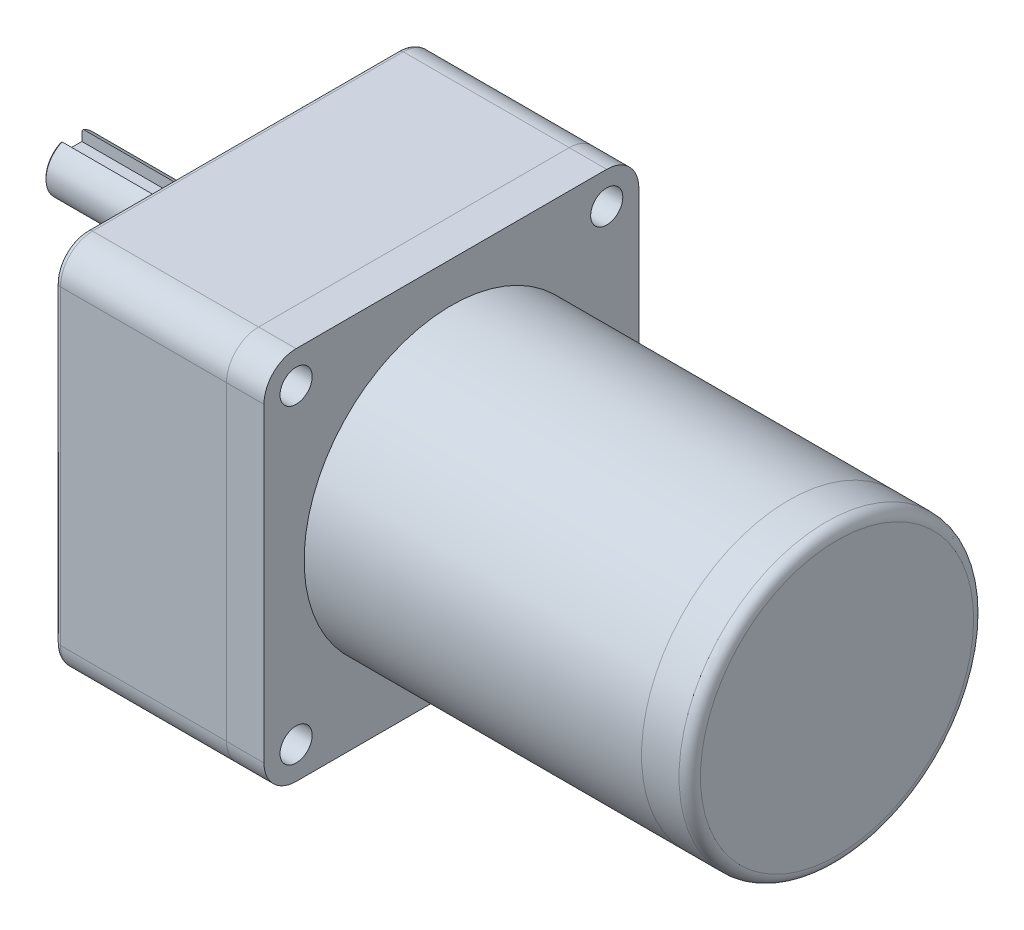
ISO-10303-21;
HEADER;
FILE_DESCRIPTION(('STEP AP214'),'2;1');
FILE_NAME('part.step','',(''),(''),'','','');
FILE_SCHEMA(('AUTOMOTIVE_DESIGN { 1 0 10303 214 1 1 1 1 }'));
ENDSEC;
DATA;
#1=APPLICATION_CONTEXT('core data for automotive mechanical design processes');
#2=APPLICATION_PROTOCOL_DEFINITION('international standard','automotive_design',2000,#1);
#3=PRODUCT_CONTEXT('',#1,'mechanical');
#4=PRODUCT('Part','Part','',(#3));
#5=PRODUCT_RELATED_PRODUCT_CATEGORY('part','',(#4));
#6=PRODUCT_DEFINITION_FORMATION('','',#4);
#7=PRODUCT_DEFINITION_CONTEXT('part definition',#1,'design');
#8=PRODUCT_DEFINITION('design','',#6,#7);
#9=PRODUCT_DEFINITION_SHAPE('','',#8);
#10=(LENGTH_UNIT() NAMED_UNIT(*) SI_UNIT(.MILLI.,.METRE.));
#11=(NAMED_UNIT(*) PLANE_ANGLE_UNIT() SI_UNIT($,.RADIAN.));
#12=(NAMED_UNIT(*) SI_UNIT($,.STERADIAN.) SOLID_ANGLE_UNIT());
#13=UNCERTAINTY_MEASURE_WITH_UNIT(LENGTH_MEASURE(1.E-05),#10,'distance_accuracy_value','');
#14=(GEOMETRIC_REPRESENTATION_CONTEXT(3) GLOBAL_UNCERTAINTY_ASSIGNED_CONTEXT((#13)) GLOBAL_UNIT_ASSIGNED_CONTEXT((#10,
#11,#12)) REPRESENTATION_CONTEXT('',''));
#15=CARTESIAN_POINT('',(0.,0.,0.));
#16=DIRECTION('',(0.,0.,1.));
#17=DIRECTION('',(1.,0.,0.));
#18=AXIS2_PLACEMENT_3D('',#15,#16,#17);
#19=CARTESIAN_POINT('',(-32.,15.,0.));
#20=DIRECTION('',(1.,0.,0.));
#21=DIRECTION('',(0.,0.,-1.));
#22=AXIS2_PLACEMENT_3D('',#19,#20,#21);
#23=CYLINDRICAL_SURFACE('',#22,5.);
#24=DIRECTION('',(1.,0.,0.));
#25=VECTOR('',#24,1.);
#26=CARTESIAN_POINT('',(-32.,19.5825756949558,2.));
#27=LINE('',#26,#25);
#28=CARTESIAN_POINT('',(-9.,19.5825756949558,2.));
#29=VERTEX_POINT('',#28);
#30=CARTESIAN_POINT('',(-31.7,19.5825756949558,2.));
#31=VERTEX_POINT('',#30);
#32=EDGE_CURVE('E131',#29,#31,#27,.F.);
#33=ORIENTED_EDGE('',*,*,#32,.T.);
#34=CARTESIAN_POINT('',(-31.7,15.,0.));
#35=DIRECTION('',(-1.,0.,0.));
#36=DIRECTION('',(0.,0.,1.));
#37=AXIS2_PLACEMENT_3D('',#34,#35,#36);
#38=CIRCLE('',#37,5.);
#39=CARTESIAN_POINT('',(-31.7,19.5825756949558,-2.));
#40=VERTEX_POINT('',#39);
#41=EDGE_CURVE('E59',#31,#40,#38,.F.);
#42=ORIENTED_EDGE('',*,*,#41,.T.);
#43=DIRECTION('',(1.,0.,0.));
#44=VECTOR('',#43,1.);
#45=CARTESIAN_POINT('',(-32.,19.5825756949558,-2.));
#46=LINE('',#45,#44);
#47=CARTESIAN_POINT('',(-9.,19.5825756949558,-2.));
#48=VERTEX_POINT('',#47);
#49=EDGE_CURVE('E126',#40,#48,#46,.T.);
#50=ORIENTED_EDGE('',*,*,#49,.T.);
#51=CARTESIAN_POINT('',(-9.,19.5825756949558,-2.));
#52=CARTESIAN_POINT('',(-8.94619414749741,19.5825646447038,-2.00000798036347));
#53=CARTESIAN_POINT('',(-8.89239433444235,19.5835230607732,-1.99782891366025));
#54=CARTESIAN_POINT('',(-8.7852287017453,19.5872962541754,-1.98915905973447));
#55=CARTESIAN_POINT('',(-8.73186272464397,19.5901103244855,-1.98266991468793));
#56=CARTESIAN_POINT('',(-8.62615317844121,19.5974978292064,-1.9654760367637));
#57=CARTESIAN_POINT('',(-8.57380641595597,19.6020643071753,-1.95478796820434));
#58=CARTESIAN_POINT('',(-8.47029922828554,19.6128005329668,-1.92931630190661));
#59=CARTESIAN_POINT('',(-8.41913887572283,19.618970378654,-1.91453245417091));
#60=CARTESIAN_POINT('',(-8.26806414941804,19.6395929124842,-1.86426971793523));
#61=CARTESIAN_POINT('',(-8.17034576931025,19.6561744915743,-1.82284489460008));
#62=CARTESIAN_POINT('',(-7.98320441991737,19.6931237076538,-1.72548191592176));
#63=CARTESIAN_POINT('',(-7.89378944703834,19.7134949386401,-1.66952996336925));
#64=CARTESIAN_POINT('',(-7.72073760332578,19.7570099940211,-1.54131835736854));
#65=CARTESIAN_POINT('',(-7.63763278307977,19.7802424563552,-1.4683691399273));
#66=CARTESIAN_POINT('',(-7.48445972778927,19.8261279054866,-1.30969646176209));
#67=CARTESIAN_POINT('',(-7.41439416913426,19.8487807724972,-1.22397038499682));
#68=CARTESIAN_POINT('',(-7.28659360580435,19.8920341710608,-1.03800590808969));
#69=CARTESIAN_POINT('',(-7.22945519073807,19.9125182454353,-0.937327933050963));
#70=CARTESIAN_POINT('',(-7.13315592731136,19.94803944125,-0.726824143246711));
#71=CARTESIAN_POINT('',(-7.09398757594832,19.9630788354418,-0.617002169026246));
#72=CARTESIAN_POINT('',(-7.03665879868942,19.9853831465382,-0.396967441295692));
#73=CARTESIAN_POINT('',(-7.01757304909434,19.9929892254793,-0.287031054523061));
#74=CARTESIAN_POINT('',(-6.99797152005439,20.0008031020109,-0.0652684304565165));
#75=CARTESIAN_POINT('',(-6.99744916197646,20.0010135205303,0.0465571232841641));
#76=CARTESIAN_POINT('',(-7.01448283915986,19.994219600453,0.262233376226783));
#77=CARTESIAN_POINT('',(-7.03102504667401,19.9876198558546,0.36617920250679));
#78=CARTESIAN_POINT('',(-7.07999342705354,19.9684927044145,0.569674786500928));
#79=CARTESIAN_POINT('',(-7.11242049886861,19.9559649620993,0.669224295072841));
#80=CARTESIAN_POINT('',(-7.19263629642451,19.9259683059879,0.862897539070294));
#81=CARTESIAN_POINT('',(-7.24064924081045,19.9084277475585,0.956916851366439));
#82=CARTESIAN_POINT('',(-7.35046458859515,19.8701460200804,1.13580746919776));
#83=CARTESIAN_POINT('',(-7.41227182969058,19.8494037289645,1.22067554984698));
#84=CARTESIAN_POINT('',(-7.55264418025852,19.8052178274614,1.38476339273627));
#85=CARTESIAN_POINT('',(-7.63204247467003,19.7816862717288,1.46324770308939));
#86=CARTESIAN_POINT('',(-7.80298009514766,19.7356195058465,1.60609926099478));
#87=CARTESIAN_POINT('',(-7.89452492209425,19.7130847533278,1.67046007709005));
#88=CARTESIAN_POINT('',(-8.09047028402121,19.6709568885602,1.78493657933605));
#89=CARTESIAN_POINT('',(-8.1951648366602,19.6514670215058,1.83458932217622));
#90=CARTESIAN_POINT('',(-8.41236152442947,19.6188610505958,1.91521298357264));
#91=CARTESIAN_POINT('',(-8.52484944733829,19.6057336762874,1.94621696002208));
#92=CARTESIAN_POINT('',(-8.69874363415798,19.5920830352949,1.9781058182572));
#93=CARTESIAN_POINT('',(-8.75865754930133,19.5885343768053,1.98630505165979));
#94=CARTESIAN_POINT('',(-8.87903501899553,19.5837754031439,1.99725282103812));
#95=CARTESIAN_POINT('',(-8.93949821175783,19.5825636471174,2.00000471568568));
#96=CARTESIAN_POINT('',(-9.,19.5825756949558,2.));
#97=B_SPLINE_CURVE_WITH_KNOTS('',3,(#51,#52,#53,#54,#55,#56,#57,#58,#59,#60,#61,#62,#63,#64,#65,
#66,#67,#68,#69,#70,#71,#72,#73,#74,#75,#76,#77,#78,#79,#80,#81,#82,#83,#84,#85,#86,#87,#88,#89,
#90,#91,#92,#93,#94,#95,#96),.UNSPECIFIED.,.F.,.F.,(4,2,2,2,2,2,2,2,2,2,2,2,2,2,2,2,2,2,2,2,2,2,
4),(0.,0.161354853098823,0.322648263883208,0.483307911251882,0.643977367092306,
0.964683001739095,1.28569434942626,1.62318047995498,1.96073580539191,2.31162858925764,
2.66237473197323,2.9961387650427,3.32978451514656,3.64468915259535,3.95961161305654,
4.27928176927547,4.59906421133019,4.93981874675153,5.28072813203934,5.63144241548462,
5.98153315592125,6.16300192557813,6.3443587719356),.UNSPECIFIED.);
#98=EDGE_CURVE('E105',#48,#29,#97,.T.);
#99=ORIENTED_EDGE('',*,*,#98,.T.);
#100=EDGE_LOOP('',(#33,#42,#50,#99));
#101=FACE_BOUND('',#100,.T.);
#102=CARTESIAN_POINT('',(-3.,15.,0.));
#103=DIRECTION('',(-1.,0.,0.));
#104=DIRECTION('',(0.,0.,1.));
#105=AXIS2_PLACEMENT_3D('',#102,#103,#104);
#106=CIRCLE('',#105,5.);
#107=CARTESIAN_POINT('',(-3.,15.,5.));
#108=VERTEX_POINT('',#107);
#109=EDGE_CURVE('E133',#108,#108,#106,.T.);
#110=ORIENTED_EDGE('',*,*,#109,.T.);
#111=EDGE_LOOP('',(#110));
#112=FACE_BOUND('',#111,.T.);
#113=ADVANCED_FACE('F46',(#101,#112),#23,.T.);
#114=CARTESIAN_POINT('',(-32.,15.,0.));
#115=DIRECTION('',(-1.,0.,0.));
#116=DIRECTION('',(0.,0.,1.));
#117=AXIS2_PLACEMENT_3D('',#114,#115,#116);
#118=PLANE('',#117);
#119=DIRECTION('',(0.,1.,0.));
#120=VECTOR('',#119,1.);
#121=CARTESIAN_POINT('',(-32.,17.5,-2.));
#122=LINE('',#121,#120);
#123=CARTESIAN_POINT('',(-32.,17.5,-2.));
#124=VERTEX_POINT('',#123);
#125=CARTESIAN_POINT('',(-32.,19.2532340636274,-2.));
#126=VERTEX_POINT('',#125);
#127=EDGE_CURVE('E107',#124,#126,#122,.T.);
#128=ORIENTED_EDGE('',*,*,#127,.T.);
#129=CARTESIAN_POINT('',(-32.,15.,0.));
#130=DIRECTION('',(-1.,0.,0.));
#131=DIRECTION('',(0.,0.,1.));
#132=AXIS2_PLACEMENT_3D('',#129,#130,#131);
#133=CIRCLE('',#132,4.70000000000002);
#134=CARTESIAN_POINT('',(-32.,19.2532340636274,2.));
#135=VERTEX_POINT('',#134);
#136=EDGE_CURVE('E141',#126,#135,#133,.T.);
#137=ORIENTED_EDGE('',*,*,#136,.T.);
#138=DIRECTION('',(0.,1.,0.));
#139=VECTOR('',#138,1.);
#140=CARTESIAN_POINT('',(-32.,17.5,2.));
#141=LINE('',#140,#139);
#142=CARTESIAN_POINT('',(-32.,17.5,2.));
#143=VERTEX_POINT('',#142);
#144=EDGE_CURVE('E127',#143,#135,#141,.T.);
#145=ORIENTED_EDGE('',*,*,#144,.F.);
#146=DIRECTION('',(0.,0.,1.));
#147=VECTOR('',#146,1.);
#148=CARTESIAN_POINT('',(-32.,17.5,-2.));
#149=LINE('',#148,#147);
#150=EDGE_CURVE('E116',#124,#143,#149,.T.);
#151=ORIENTED_EDGE('',*,*,#150,.F.);
#152=EDGE_LOOP('',(#128,#137,#145,#151));
#153=FACE_BOUND('',#152,.T.);
#154=ADVANCED_FACE('F152',(#153),#118,.T.);
#155=CARTESIAN_POINT('',(-3.,15.,0.));
#156=DIRECTION('',(-1.,0.,0.));
#157=DIRECTION('',(0.,0.,1.));
#158=AXIS2_PLACEMENT_3D('',#155,#156,#157);
#159=PLANE('',#158);
#160=ORIENTED_EDGE('',*,*,#109,.F.);
#161=EDGE_LOOP('',(#160));
#162=FACE_BOUND('',#161,.T.);
#163=ADVANCED_FACE('F149',(#162),#159,.F.);
#164=CARTESIAN_POINT('',(-9.,17.5,0.));
#165=DIRECTION('',(0.,1.,0.));
#166=DIRECTION('',(0.,0.,1.));
#167=AXIS2_PLACEMENT_3D('',#164,#165,#166);
#168=CYLINDRICAL_SURFACE('',#167,2.);
#169=DIRECTION('',(0.,1.,0.));
#170=VECTOR('',#169,1.);
#171=CARTESIAN_POINT('',(-9.,17.5,-2.));
#172=LINE('',#171,#170);
#173=CARTESIAN_POINT('',(-9.,17.5,-2.));
#174=VERTEX_POINT('',#173);
#175=EDGE_CURVE('E97',#174,#48,#172,.T.);
#176=ORIENTED_EDGE('',*,*,#175,.F.);
#177=CARTESIAN_POINT('',(-9.,17.5,0.));
#178=DIRECTION('',(0.,1.,0.));
#179=DIRECTION('',(0.,0.,1.));
#180=AXIS2_PLACEMENT_3D('',#177,#178,#179);
#181=CIRCLE('',#180,2.);
#182=CARTESIAN_POINT('',(-9.,17.5,2.));
#183=VERTEX_POINT('',#182);
#184=EDGE_CURVE('E102',#183,#174,#181,.T.);
#185=ORIENTED_EDGE('',*,*,#184,.F.);
#186=DIRECTION('',(0.,1.,0.));
#187=VECTOR('',#186,1.);
#188=CARTESIAN_POINT('',(-9.,17.5,2.));
#189=LINE('',#188,#187);
#190=EDGE_CURVE('E124',#183,#29,#189,.T.);
#191=ORIENTED_EDGE('',*,*,#190,.T.);
#192=ORIENTED_EDGE('',*,*,#98,.F.);
#193=EDGE_LOOP('',(#176,#185,#191,#192));
#194=FACE_BOUND('',#193,.T.);
#195=ADVANCED_FACE('F99',(#194),#168,.F.);
#196=CARTESIAN_POINT('',(-32.,17.5,2.));
#197=DIRECTION('',(0.,0.,1.));
#198=DIRECTION('',(1.,0.,0.));
#199=AXIS2_PLACEMENT_3D('',#196,#197,#198);
#200=PLANE('',#199);
#201=ORIENTED_EDGE('',*,*,#144,.T.);
#202=CARTESIAN_POINT('',(-32.,19.2532340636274,2.));
#203=CARTESIAN_POINT('',(-31.950173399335,19.3082822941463,2.));
#204=CARTESIAN_POINT('',(-31.9002600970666,19.3632515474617,2.));
#205=CARTESIAN_POINT('',(-31.8002600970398,19.4730320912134,2.));
#206=CARTESIAN_POINT('',(-31.7501733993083,19.5278433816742,2.));
#207=CARTESIAN_POINT('',(-31.7,19.5825756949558,2.));
#208=B_SPLINE_CURVE_WITH_KNOTS('',3,(#202,#203,#204,#205,#206,#207),.UNSPECIFIED.,.F.,.F.,(4,2,
4),(0.,0.22274785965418,0.445495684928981),.UNSPECIFIED.);
#209=EDGE_CURVE('E73',#135,#31,#208,.T.);
#210=ORIENTED_EDGE('',*,*,#209,.T.);
#211=ORIENTED_EDGE('',*,*,#32,.F.);
#212=ORIENTED_EDGE('',*,*,#190,.F.);
#213=DIRECTION('',(1.,0.,0.));
#214=VECTOR('',#213,1.);
#215=CARTESIAN_POINT('',(-32.,17.5,2.));
#216=LINE('',#215,#214);
#217=EDGE_CURVE('E108',#143,#183,#216,.T.);
#218=ORIENTED_EDGE('',*,*,#217,.F.);
#219=EDGE_LOOP('',(#201,#210,#211,#212,#218));
#220=FACE_BOUND('',#219,.T.);
#221=ADVANCED_FACE('F148',(#220),#200,.F.);
#222=CARTESIAN_POINT('',(-9.,17.5,-2.));
#223=DIRECTION('',(0.,0.,-1.));
#224=DIRECTION('',(-1.,0.,0.));
#225=AXIS2_PLACEMENT_3D('',#222,#223,#224);
#226=PLANE('',#225);
#227=ORIENTED_EDGE('',*,*,#49,.F.);
#228=CARTESIAN_POINT('',(-31.7,19.5825756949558,-2.));
#229=CARTESIAN_POINT('',(-31.7501733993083,19.5278433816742,-2.));
#230=CARTESIAN_POINT('',(-31.8002600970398,19.4730320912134,-2.));
#231=CARTESIAN_POINT('',(-31.9002600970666,19.3632515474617,-2.));
#232=CARTESIAN_POINT('',(-31.950173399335,19.3082822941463,-2.));
#233=CARTESIAN_POINT('',(-32.,19.2532340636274,-2.));
#234=B_SPLINE_CURVE_WITH_KNOTS('',3,(#228,#229,#230,#231,#232,#233),.UNSPECIFIED.,.F.,.F.,(4,2,
4),(0.,0.2227478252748,0.445495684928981),.UNSPECIFIED.);
#235=EDGE_CURVE('E12',#40,#126,#234,.T.);
#236=ORIENTED_EDGE('',*,*,#235,.T.);
#237=ORIENTED_EDGE('',*,*,#127,.F.);
#238=DIRECTION('',(-1.,0.,0.));
#239=VECTOR('',#238,1.);
#240=CARTESIAN_POINT('',(-9.,17.5,-2.));
#241=LINE('',#240,#239);
#242=EDGE_CURVE('E111',#174,#124,#241,.T.);
#243=ORIENTED_EDGE('',*,*,#242,.F.);
#244=ORIENTED_EDGE('',*,*,#175,.T.);
#245=EDGE_LOOP('',(#227,#236,#237,#243,#244));
#246=FACE_BOUND('',#245,.T.);
#247=ADVANCED_FACE('F112',(#246),#226,.F.);
#248=CARTESIAN_POINT('',(-9.,17.5,0.));
#249=DIRECTION('',(0.,1.,0.));
#250=DIRECTION('',(0.,0.,1.));
#251=AXIS2_PLACEMENT_3D('',#248,#249,#250);
#252=PLANE('',#251);
#253=ORIENTED_EDGE('',*,*,#184,.T.);
#254=ORIENTED_EDGE('',*,*,#242,.T.);
#255=ORIENTED_EDGE('',*,*,#150,.T.);
#256=ORIENTED_EDGE('',*,*,#217,.T.);
#257=EDGE_LOOP('',(#253,#254,#255,#256));
#258=FACE_BOUND('',#257,.T.);
#259=ADVANCED_FACE('F118',(#258),#252,.T.);
#260=CARTESIAN_POINT('',(-32.,15.,0.));
#261=DIRECTION('',(1.,0.,0.));
#262=DIRECTION('',(0.,0.,-1.));
#263=AXIS2_PLACEMENT_3D('',#260,#261,#262);
#264=CONICAL_SURFACE('',#263,4.70000000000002,0.78539816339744);
#265=ORIENTED_EDGE('',*,*,#235,.F.);
#266=ORIENTED_EDGE('',*,*,#41,.F.);
#267=ORIENTED_EDGE('',*,*,#209,.F.);
#268=ORIENTED_EDGE('',*,*,#136,.F.);
#269=EDGE_LOOP('',(#265,#266,#267,#268));
#270=FACE_BOUND('',#269,.T.);
#271=ADVANCED_FACE('F48',(#270),#264,.T.);
#272=CLOSED_SHELL('',(#113,#154,#163,#195,#221,#247,#259,#271));
#273=MANIFOLD_SOLID_BREP('B2',#272);
#274=CARTESIAN_POINT('',(-3.,15.,0.));
#275=DIRECTION('',(1.,0.,0.));
#276=DIRECTION('',(0.,0.,-1.));
#277=AXIS2_PLACEMENT_3D('',#274,#275,#276);
#278=CYLINDRICAL_SURFACE('',#277,12.);
#279=CARTESIAN_POINT('',(-2.5,15.,0.));
#280=DIRECTION('',(-1.,0.,0.));
#281=DIRECTION('',(0.,0.,1.));
#282=AXIS2_PLACEMENT_3D('',#279,#280,#281);
#283=CIRCLE('',#282,12.);
#284=CARTESIAN_POINT('',(-2.5,15.,12.));
#285=VERTEX_POINT('',#284);
#286=EDGE_CURVE('E45',#285,#285,#283,.F.);
#287=ORIENTED_EDGE('',*,*,#286,.T.);
#288=EDGE_LOOP('',(#287));
#289=FACE_BOUND('',#288,.T.);
#290=CARTESIAN_POINT('',(0.,15.,0.));
#291=DIRECTION('',(-1.,0.,0.));
#292=DIRECTION('',(0.,0.,1.));
#293=AXIS2_PLACEMENT_3D('',#290,#291,#292);
#294=CIRCLE('',#293,12.);
#295=CARTESIAN_POINT('',(0.,15.,12.));
#296=VERTEX_POINT('',#295);
#297=EDGE_CURVE('E245',#296,#296,#294,.T.);
#298=ORIENTED_EDGE('',*,*,#297,.T.);
#299=EDGE_LOOP('',(#298));
#300=FACE_BOUND('',#299,.T.);
#301=ADVANCED_FACE('F234',(#289,#300),#278,.T.);
#302=CARTESIAN_POINT('',(-3.,15.,0.));
#303=DIRECTION('',(-1.,0.,0.));
#304=DIRECTION('',(0.,0.,1.));
#305=AXIS2_PLACEMENT_3D('',#302,#303,#304);
#306=PLANE('',#305);
#307=CARTESIAN_POINT('',(-3.,15.,0.));
#308=DIRECTION('',(-1.,0.,0.));
#309=DIRECTION('',(0.,0.,1.));
#310=AXIS2_PLACEMENT_3D('',#307,#308,#309);
#311=CIRCLE('',#310,11.5);
#312=CARTESIAN_POINT('',(-3.,15.,11.5));
#313=VERTEX_POINT('',#312);
#314=EDGE_CURVE('E241',#313,#313,#311,.T.);
#315=ORIENTED_EDGE('',*,*,#314,.T.);
#316=EDGE_LOOP('',(#315));
#317=FACE_BOUND('',#316,.T.);
#318=ADVANCED_FACE('F255',(#317),#306,.T.);
#319=CARTESIAN_POINT('',(0.,15.,0.));
#320=DIRECTION('',(-1.,0.,0.));
#321=DIRECTION('',(0.,0.,1.));
#322=AXIS2_PLACEMENT_3D('',#319,#320,#321);
#323=PLANE('',#322);
#324=ORIENTED_EDGE('',*,*,#297,.F.);
#325=EDGE_LOOP('',(#324));
#326=FACE_BOUND('',#325,.T.);
#327=ADVANCED_FACE('F253',(#326),#323,.F.);
#328=CARTESIAN_POINT('',(-2.5,15.,0.));
#329=DIRECTION('',(-1.,0.,0.));
#330=DIRECTION('',(0.,0.,1.));
#331=AXIS2_PLACEMENT_3D('',#328,#329,#330);
#332=TOROIDAL_SURFACE('',#331,11.5,0.5);
#333=ORIENTED_EDGE('',*,*,#286,.F.);
#334=EDGE_LOOP('',(#333));
#335=FACE_BOUND('',#334,.T.);
#336=ORIENTED_EDGE('',*,*,#314,.F.);
#337=EDGE_LOOP('',(#336));
#338=FACE_BOUND('',#337,.T.);
#339=ADVANCED_FACE('F236',(#335,#338),#332,.T.);
#340=CLOSED_SHELL('',(#301,#318,#327,#339));
#341=MANIFOLD_SOLID_BREP('B6',#340);
#342=CARTESIAN_POINT('',(111.,0.,0.));
#343=DIRECTION('',(-1.,0.,0.));
#344=DIRECTION('',(0.,0.,1.));
#345=AXIS2_PLACEMENT_3D('',#342,#343,#344);
#346=CYLINDRICAL_SURFACE('',#345,27.5);
#347=CARTESIAN_POINT('',(109.,0.,0.));
#348=DIRECTION('',(1.,0.,0.));
#349=DIRECTION('',(0.,0.,-1.));
#350=AXIS2_PLACEMENT_3D('',#347,#348,#349);
#351=CIRCLE('',#350,27.5);
#352=CARTESIAN_POINT('',(109.,0.,-27.5));
#353=VERTEX_POINT('',#352);
#354=EDGE_CURVE('E233',#353,#353,#351,.F.);
#355=ORIENTED_EDGE('',*,*,#354,.T.);
#356=EDGE_LOOP('',(#355));
#357=FACE_BOUND('',#356,.T.);
#358=CARTESIAN_POINT('',(102.,0.,0.));
#359=DIRECTION('',(1.,0.,0.));
#360=DIRECTION('',(0.,0.,-1.));
#361=AXIS2_PLACEMENT_3D('',#358,#359,#360);
#362=CIRCLE('',#361,27.5);
#363=CARTESIAN_POINT('',(102.,0.,-27.5));
#364=VERTEX_POINT('',#363);
#365=EDGE_CURVE('E309',#364,#364,#362,.T.);
#366=ORIENTED_EDGE('',*,*,#365,.T.);
#367=EDGE_LOOP('',(#366));
#368=FACE_BOUND('',#367,.T.);
#369=ADVANCED_FACE('F298',(#357,#368),#346,.T.);
#370=CARTESIAN_POINT('',(111.,0.,0.));
#371=DIRECTION('',(1.,0.,0.));
#372=DIRECTION('',(0.,0.,-1.));
#373=AXIS2_PLACEMENT_3D('',#370,#371,#372);
#374=PLANE('',#373);
#375=CARTESIAN_POINT('',(111.,0.,0.));
#376=DIRECTION('',(1.,0.,0.));
#377=DIRECTION('',(0.,0.,-1.));
#378=AXIS2_PLACEMENT_3D('',#375,#376,#377);
#379=CIRCLE('',#378,25.5);
#380=CARTESIAN_POINT('',(111.,0.,-25.5));
#381=VERTEX_POINT('',#380);
#382=EDGE_CURVE('E305',#381,#381,#379,.T.);
#383=ORIENTED_EDGE('',*,*,#382,.T.);
#384=EDGE_LOOP('',(#383));
#385=FACE_BOUND('',#384,.T.);
#386=ADVANCED_FACE('F319',(#385),#374,.T.);
#387=CARTESIAN_POINT('',(102.,0.,0.));
#388=DIRECTION('',(1.,0.,0.));
#389=DIRECTION('',(0.,0.,-1.));
#390=AXIS2_PLACEMENT_3D('',#387,#388,#389);
#391=PLANE('',#390);
#392=ORIENTED_EDGE('',*,*,#365,.F.);
#393=EDGE_LOOP('',(#392));
#394=FACE_BOUND('',#393,.T.);
#395=ADVANCED_FACE('F317',(#394),#391,.F.);
#396=CARTESIAN_POINT('',(109.,0.,0.));
#397=DIRECTION('',(1.,0.,0.));
#398=DIRECTION('',(0.,0.,-1.));
#399=AXIS2_PLACEMENT_3D('',#396,#397,#398);
#400=TOROIDAL_SURFACE('',#399,25.5,2.);
#401=ORIENTED_EDGE('',*,*,#354,.F.);
#402=EDGE_LOOP('',(#401));
#403=FACE_BOUND('',#402,.T.);
#404=ORIENTED_EDGE('',*,*,#382,.F.);
#405=EDGE_LOOP('',(#404));
#406=FACE_BOUND('',#405,.T.);
#407=ADVANCED_FACE('F300',(#403,#406),#400,.T.);
#408=CLOSED_SHELL('',(#369,#386,#395,#407));
#409=MANIFOLD_SOLID_BREP('B40',#408);
#410=CARTESIAN_POINT('',(102.,0.,0.));
#411=DIRECTION('',(-1.,0.,0.));
#412=DIRECTION('',(0.,0.,1.));
#413=AXIS2_PLACEMENT_3D('',#410,#411,#412);
#414=CYLINDRICAL_SURFACE('',#413,27.5);
#415=CARTESIAN_POINT('',(102.,0.,0.));
#416=DIRECTION('',(1.,0.,0.));
#417=DIRECTION('',(0.,0.,-1.));
#418=AXIS2_PLACEMENT_3D('',#415,#416,#417);
#419=CIRCLE('',#418,27.5);
#420=CARTESIAN_POINT('',(102.,0.,-27.5));
#421=VERTEX_POINT('',#420);
#422=EDGE_CURVE('E297',#421,#421,#419,.T.);
#423=ORIENTED_EDGE('',*,*,#422,.F.);
#424=EDGE_LOOP('',(#423));
#425=FACE_BOUND('',#424,.T.);
#426=CARTESIAN_POINT('',(39.,0.,0.));
#427=DIRECTION('',(1.,0.,0.));
#428=DIRECTION('',(0.,0.,-1.));
#429=AXIS2_PLACEMENT_3D('',#426,#427,#428);
#430=CIRCLE('',#429,27.5);
#431=CARTESIAN_POINT('',(39.,0.,-27.5));
#432=VERTEX_POINT('',#431);
#433=EDGE_CURVE('E367',#432,#432,#430,.T.);
#434=ORIENTED_EDGE('',*,*,#433,.T.);
#435=EDGE_LOOP('',(#434));
#436=FACE_BOUND('',#435,.T.);
#437=ADVANCED_FACE('F364',(#425,#436),#414,.T.);
#438=CARTESIAN_POINT('',(102.,0.,0.));
#439=DIRECTION('',(1.,0.,0.));
#440=DIRECTION('',(0.,0.,-1.));
#441=AXIS2_PLACEMENT_3D('',#438,#439,#440);
#442=PLANE('',#441);
#443=ORIENTED_EDGE('',*,*,#422,.T.);
#444=EDGE_LOOP('',(#443));
#445=FACE_BOUND('',#444,.T.);
#446=ADVANCED_FACE('F379',(#445),#442,.T.);
#447=CARTESIAN_POINT('',(39.,0.,0.));
#448=DIRECTION('',(1.,0.,0.));
#449=DIRECTION('',(0.,0.,-1.));
#450=AXIS2_PLACEMENT_3D('',#447,#448,#449);
#451=PLANE('',#450);
#452=ORIENTED_EDGE('',*,*,#433,.F.);
#453=EDGE_LOOP('',(#452));
#454=FACE_BOUND('',#453,.T.);
#455=ADVANCED_FACE('F377',(#454),#451,.F.);
#456=CLOSED_SHELL('',(#437,#446,#455));
#457=MANIFOLD_SOLID_BREP('B228',#456);
#458=CARTESIAN_POINT('',(39.,29.,-29.));
#459=DIRECTION('',(-1.,0.,0.));
#460=DIRECTION('',(0.,0.,1.));
#461=AXIS2_PLACEMENT_3D('',#458,#459,#460);
#462=CYLINDRICAL_SURFACE('',#461,6.);
#463=CARTESIAN_POINT('',(32.,29.,-29.));
#464=DIRECTION('',(1.,0.,0.));
#465=DIRECTION('',(0.,0.,1.));
#466=AXIS2_PLACEMENT_3D('',#463,#464,#465);
#467=CIRCLE('',#466,6.);
#468=CARTESIAN_POINT('',(32.,29.,-35.));
#469=VERTEX_POINT('',#468);
#470=CARTESIAN_POINT('',(32.,35.,-29.));
#471=VERTEX_POINT('',#470);
#472=EDGE_CURVE('E512',#469,#471,#467,.T.);
#473=ORIENTED_EDGE('',*,*,#472,.T.);
#474=DIRECTION('',(-1.,0.,0.));
#475=VECTOR('',#474,1.);
#476=CARTESIAN_POINT('',(39.,35.,-29.));
#477=LINE('',#476,#475);
#478=CARTESIAN_POINT('',(39.,35.,-29.));
#479=VERTEX_POINT('',#478);
#480=EDGE_CURVE('E362',#479,#471,#477,.T.);
#481=ORIENTED_EDGE('',*,*,#480,.F.);
#482=CARTESIAN_POINT('',(39.,29.,-29.));
#483=DIRECTION('',(1.,0.,0.));
#484=DIRECTION('',(0.,0.,1.));
#485=AXIS2_PLACEMENT_3D('',#482,#483,#484);
#486=CIRCLE('',#485,6.);
#487=CARTESIAN_POINT('',(39.,29.,-35.));
#488=VERTEX_POINT('',#487);
#489=EDGE_CURVE('E526',#488,#479,#486,.T.);
#490=ORIENTED_EDGE('',*,*,#489,.F.);
#491=DIRECTION('',(-1.,0.,0.));
#492=VECTOR('',#491,1.);
#493=CARTESIAN_POINT('',(39.,29.,-35.));
#494=LINE('',#493,#492);
#495=EDGE_CURVE('E508',#488,#469,#494,.T.);
#496=ORIENTED_EDGE('',*,*,#495,.T.);
#497=EDGE_LOOP('',(#473,#481,#490,#496));
#498=FACE_BOUND('',#497,.T.);
#499=ADVANCED_FACE('F414',(#498),#462,.T.);
#500=CARTESIAN_POINT('',(39.,35.,29.));
#501=DIRECTION('',(0.,-1.,0.));
#502=DIRECTION('',(0.,0.,-1.));
#503=AXIS2_PLACEMENT_3D('',#500,#501,#502);
#504=PLANE('',#503);
#505=DIRECTION('',(0.,0.,1.));
#506=VECTOR('',#505,1.);
#507=CARTESIAN_POINT('',(32.,35.,29.));
#508=LINE('',#507,#506);
#509=CARTESIAN_POINT('',(32.,35.,29.));
#510=VERTEX_POINT('',#509);
#511=EDGE_CURVE('E515',#471,#510,#508,.T.);
#512=ORIENTED_EDGE('',*,*,#511,.T.);
#513=DIRECTION('',(-1.,0.,0.));
#514=VECTOR('',#513,1.);
#515=CARTESIAN_POINT('',(39.,35.,29.));
#516=LINE('',#515,#514);
#517=CARTESIAN_POINT('',(39.,35.,29.));
#518=VERTEX_POINT('',#517);
#519=EDGE_CURVE('E423',#518,#510,#516,.T.);
#520=ORIENTED_EDGE('',*,*,#519,.F.);
#521=DIRECTION('',(0.,0.,1.));
#522=VECTOR('',#521,1.);
#523=CARTESIAN_POINT('',(39.,35.,29.));
#524=LINE('',#523,#522);
#525=EDGE_CURVE('E475',#479,#518,#524,.T.);
#526=ORIENTED_EDGE('',*,*,#525,.F.);
#527=ORIENTED_EDGE('',*,*,#480,.T.);
#528=EDGE_LOOP('',(#512,#520,#526,#527));
#529=FACE_BOUND('',#528,.T.);
#530=ADVANCED_FACE('F580',(#529),#504,.F.);
#531=CARTESIAN_POINT('',(39.,29.,29.));
#532=DIRECTION('',(-1.,0.,0.));
#533=DIRECTION('',(0.,0.,1.));
#534=AXIS2_PLACEMENT_3D('',#531,#532,#533);
#535=CYLINDRICAL_SURFACE('',#534,6.);
#536=CARTESIAN_POINT('',(32.,29.,29.));
#537=DIRECTION('',(1.,0.,0.));
#538=DIRECTION('',(0.,0.,1.));
#539=AXIS2_PLACEMENT_3D('',#536,#537,#538);
#540=CIRCLE('',#539,6.);
#541=CARTESIAN_POINT('',(32.,29.,35.));
#542=VERTEX_POINT('',#541);
#543=EDGE_CURVE('E517',#510,#542,#540,.T.);
#544=ORIENTED_EDGE('',*,*,#543,.T.);
#545=DIRECTION('',(-1.,0.,0.));
#546=VECTOR('',#545,1.);
#547=CARTESIAN_POINT('',(39.,29.,35.));
#548=LINE('',#547,#546);
#549=CARTESIAN_POINT('',(39.,29.,35.));
#550=VERTEX_POINT('',#549);
#551=EDGE_CURVE('E533',#550,#542,#548,.T.);
#552=ORIENTED_EDGE('',*,*,#551,.F.);
#553=CARTESIAN_POINT('',(39.,29.,29.));
#554=DIRECTION('',(1.,0.,0.));
#555=DIRECTION('',(0.,0.,1.));
#556=AXIS2_PLACEMENT_3D('',#553,#554,#555);
#557=CIRCLE('',#556,6.);
#558=EDGE_CURVE('E681',#518,#550,#557,.T.);
#559=ORIENTED_EDGE('',*,*,#558,.F.);
#560=ORIENTED_EDGE('',*,*,#519,.T.);
#561=EDGE_LOOP('',(#544,#552,#559,#560));
#562=FACE_BOUND('',#561,.T.);
#563=ADVANCED_FACE('F584',(#562),#535,.T.);
#564=CARTESIAN_POINT('',(39.,-29.,35.));
#565=DIRECTION('',(0.,0.,-1.));
#566=DIRECTION('',(-1.,0.,0.));
#567=AXIS2_PLACEMENT_3D('',#564,#565,#566);
#568=PLANE('',#567);
#569=DIRECTION('',(0.,-1.,0.));
#570=VECTOR('',#569,1.);
#571=CARTESIAN_POINT('',(32.,-29.,35.));
#572=LINE('',#571,#570);
#573=CARTESIAN_POINT('',(32.,-29.,35.));
#574=VERTEX_POINT('',#573);
#575=EDGE_CURVE('E519',#542,#574,#572,.T.);
#576=ORIENTED_EDGE('',*,*,#575,.T.);
#577=DIRECTION('',(-1.,0.,0.));
#578=VECTOR('',#577,1.);
#579=CARTESIAN_POINT('',(39.,-29.,35.));
#580=LINE('',#579,#578);
#581=CARTESIAN_POINT('',(39.,-29.,35.));
#582=VERTEX_POINT('',#581);
#583=EDGE_CURVE('E530',#582,#574,#580,.T.);
#584=ORIENTED_EDGE('',*,*,#583,.F.);
#585=DIRECTION('',(0.,-1.,0.));
#586=VECTOR('',#585,1.);
#587=CARTESIAN_POINT('',(39.,-29.,35.));
#588=LINE('',#587,#586);
#589=EDGE_CURVE('E683',#550,#582,#588,.T.);
#590=ORIENTED_EDGE('',*,*,#589,.F.);
#591=ORIENTED_EDGE('',*,*,#551,.T.);
#592=EDGE_LOOP('',(#576,#584,#590,#591));
#593=FACE_BOUND('',#592,.T.);
#594=ADVANCED_FACE('F588',(#593),#568,.F.);
#595=CARTESIAN_POINT('',(39.,-29.,29.));
#596=DIRECTION('',(-1.,0.,0.));
#597=DIRECTION('',(0.,0.,1.));
#598=AXIS2_PLACEMENT_3D('',#595,#596,#597);
#599=CYLINDRICAL_SURFACE('',#598,6.);
#600=CARTESIAN_POINT('',(32.,-29.,29.));
#601=DIRECTION('',(1.,0.,0.));
#602=DIRECTION('',(0.,0.,1.));
#603=AXIS2_PLACEMENT_3D('',#600,#601,#602);
#604=CIRCLE('',#603,6.);
#605=CARTESIAN_POINT('',(32.,-35.,29.));
#606=VERTEX_POINT('',#605);
#607=EDGE_CURVE('E521',#574,#606,#604,.T.);
#608=ORIENTED_EDGE('',*,*,#607,.T.);
#609=DIRECTION('',(-1.,0.,0.));
#610=VECTOR('',#609,1.);
#611=CARTESIAN_POINT('',(39.,-35.,29.));
#612=LINE('',#611,#610);
#613=CARTESIAN_POINT('',(39.,-35.,29.));
#614=VERTEX_POINT('',#613);
#615=EDGE_CURVE('E503',#614,#606,#612,.T.);
#616=ORIENTED_EDGE('',*,*,#615,.F.);
#617=CARTESIAN_POINT('',(39.,-29.,29.));
#618=DIRECTION('',(1.,0.,0.));
#619=DIRECTION('',(0.,0.,1.));
#620=AXIS2_PLACEMENT_3D('',#617,#618,#619);
#621=CIRCLE('',#620,6.);
#622=EDGE_CURVE('E494',#582,#614,#621,.T.);
#623=ORIENTED_EDGE('',*,*,#622,.F.);
#624=ORIENTED_EDGE('',*,*,#583,.T.);
#625=EDGE_LOOP('',(#608,#616,#623,#624));
#626=FACE_BOUND('',#625,.T.);
#627=ADVANCED_FACE('F594',(#626),#599,.T.);
#628=CARTESIAN_POINT('',(39.,-35.,29.));
#629=DIRECTION('',(0.,1.,0.));
#630=DIRECTION('',(0.,0.,1.));
#631=AXIS2_PLACEMENT_3D('',#628,#629,#630);
#632=PLANE('',#631);
#633=DIRECTION('',(0.,0.,-1.));
#634=VECTOR('',#633,1.);
#635=CARTESIAN_POINT('',(32.,-35.,29.));
#636=LINE('',#635,#634);
#637=CARTESIAN_POINT('',(32.,-35.,-29.));
#638=VERTEX_POINT('',#637);
#639=EDGE_CURVE('E502',#606,#638,#636,.T.);
#640=ORIENTED_EDGE('',*,*,#639,.T.);
#641=DIRECTION('',(-1.,0.,0.));
#642=VECTOR('',#641,1.);
#643=CARTESIAN_POINT('',(39.,-35.,-29.));
#644=LINE('',#643,#642);
#645=CARTESIAN_POINT('',(39.,-35.,-29.));
#646=VERTEX_POINT('',#645);
#647=EDGE_CURVE('E499',#646,#638,#644,.T.);
#648=ORIENTED_EDGE('',*,*,#647,.F.);
#649=DIRECTION('',(0.,0.,-1.));
#650=VECTOR('',#649,1.);
#651=CARTESIAN_POINT('',(39.,-35.,29.));
#652=LINE('',#651,#650);
#653=EDGE_CURVE('E488',#614,#646,#652,.T.);
#654=ORIENTED_EDGE('',*,*,#653,.F.);
#655=ORIENTED_EDGE('',*,*,#615,.T.);
#656=EDGE_LOOP('',(#640,#648,#654,#655));
#657=FACE_BOUND('',#656,.T.);
#658=ADVANCED_FACE('F500',(#657),#632,.F.);
#659=CARTESIAN_POINT('',(39.,-29.,-29.));
#660=DIRECTION('',(-1.,0.,0.));
#661=DIRECTION('',(0.,0.,1.));
#662=AXIS2_PLACEMENT_3D('',#659,#660,#661);
#663=CYLINDRICAL_SURFACE('',#662,6.);
#664=CARTESIAN_POINT('',(32.,-29.,-29.));
#665=DIRECTION('',(1.,0.,0.));
#666=DIRECTION('',(0.,0.,-1.));
#667=AXIS2_PLACEMENT_3D('',#664,#665,#666);
#668=CIRCLE('',#667,6.);
#669=CARTESIAN_POINT('',(32.,-29.,-35.));
#670=VERTEX_POINT('',#669);
#671=EDGE_CURVE('E461',#638,#670,#668,.T.);
#672=ORIENTED_EDGE('',*,*,#671,.T.);
#673=DIRECTION('',(-1.,0.,0.));
#674=VECTOR('',#673,1.);
#675=CARTESIAN_POINT('',(39.,-29.,-35.));
#676=LINE('',#675,#674);
#677=CARTESIAN_POINT('',(39.,-29.,-35.));
#678=VERTEX_POINT('',#677);
#679=EDGE_CURVE('E504',#678,#670,#676,.T.);
#680=ORIENTED_EDGE('',*,*,#679,.F.);
#681=CARTESIAN_POINT('',(39.,-29.,-29.));
#682=DIRECTION('',(1.,0.,0.));
#683=DIRECTION('',(0.,0.,-1.));
#684=AXIS2_PLACEMENT_3D('',#681,#682,#683);
#685=CIRCLE('',#684,6.);
#686=EDGE_CURVE('E492',#646,#678,#685,.T.);
#687=ORIENTED_EDGE('',*,*,#686,.F.);
#688=ORIENTED_EDGE('',*,*,#647,.T.);
#689=EDGE_LOOP('',(#672,#680,#687,#688));
#690=FACE_BOUND('',#689,.T.);
#691=ADVANCED_FACE('F506',(#690),#663,.T.);
#692=CARTESIAN_POINT('',(39.,-29.,-35.));
#693=DIRECTION('',(0.,0.,1.));
#694=DIRECTION('',(1.,0.,0.));
#695=AXIS2_PLACEMENT_3D('',#692,#693,#694);
#696=PLANE('',#695);
#697=DIRECTION('',(0.,1.,0.));
#698=VECTOR('',#697,1.);
#699=CARTESIAN_POINT('',(32.,-29.,-35.));
#700=LINE('',#699,#698);
#701=EDGE_CURVE('E467',#670,#469,#700,.T.);
#702=ORIENTED_EDGE('',*,*,#701,.T.);
#703=ORIENTED_EDGE('',*,*,#495,.F.);
#704=DIRECTION('',(0.,1.,0.));
#705=VECTOR('',#704,1.);
#706=CARTESIAN_POINT('',(39.,-29.,-35.));
#707=LINE('',#706,#705);
#708=EDGE_CURVE('E432',#678,#488,#707,.T.);
#709=ORIENTED_EDGE('',*,*,#708,.F.);
#710=ORIENTED_EDGE('',*,*,#679,.T.);
#711=EDGE_LOOP('',(#702,#703,#709,#710));
#712=FACE_BOUND('',#711,.T.);
#713=ADVANCED_FACE('F569',(#712),#696,.F.);
#714=CARTESIAN_POINT('',(39.,29.,-29.));
#715=DIRECTION('',(-1.,0.,0.));
#716=DIRECTION('',(0.,0.,1.));
#717=AXIS2_PLACEMENT_3D('',#714,#715,#716);
#718=PLANE('',#717);
#719=CARTESIAN_POINT('',(39.,29.,29.));
#720=DIRECTION('',(1.,0.,0.));
#721=DIRECTION('',(0.,0.,-1.));
#722=AXIS2_PLACEMENT_3D('',#719,#720,#721);
#723=CIRCLE('',#722,3.);
#724=CARTESIAN_POINT('',(39.,29.,26.));
#725=VERTEX_POINT('',#724);
#726=EDGE_CURVE('E542',#725,#725,#723,.T.);
#727=ORIENTED_EDGE('',*,*,#726,.F.);
#728=EDGE_LOOP('',(#727));
#729=FACE_BOUND('',#728,.T.);
#730=CARTESIAN_POINT('',(39.,29.,-29.));
#731=DIRECTION('',(1.,0.,0.));
#732=DIRECTION('',(0.,0.,-1.));
#733=AXIS2_PLACEMENT_3D('',#730,#731,#732);
#734=CIRCLE('',#733,3.);
#735=CARTESIAN_POINT('',(39.,29.,-32.));
#736=VERTEX_POINT('',#735);
#737=EDGE_CURVE('E667',#736,#736,#734,.T.);
#738=ORIENTED_EDGE('',*,*,#737,.F.);
#739=EDGE_LOOP('',(#738));
#740=FACE_BOUND('',#739,.T.);
#741=CARTESIAN_POINT('',(39.,-29.,-29.));
#742=DIRECTION('',(1.,0.,0.));
#743=DIRECTION('',(0.,0.,-1.));
#744=AXIS2_PLACEMENT_3D('',#741,#742,#743);
#745=CIRCLE('',#744,3.);
#746=CARTESIAN_POINT('',(39.,-29.,-32.));
#747=VERTEX_POINT('',#746);
#748=EDGE_CURVE('E669',#747,#747,#745,.T.);
#749=ORIENTED_EDGE('',*,*,#748,.F.);
#750=EDGE_LOOP('',(#749));
#751=FACE_BOUND('',#750,.T.);
#752=CARTESIAN_POINT('',(39.,-29.,29.));
#753=DIRECTION('',(1.,0.,0.));
#754=DIRECTION('',(0.,0.,-1.));
#755=AXIS2_PLACEMENT_3D('',#752,#753,#754);
#756=CIRCLE('',#755,3.);
#757=CARTESIAN_POINT('',(39.,-29.,26.));
#758=VERTEX_POINT('',#757);
#759=EDGE_CURVE('E674',#758,#758,#756,.T.);
#760=ORIENTED_EDGE('',*,*,#759,.F.);
#761=EDGE_LOOP('',(#760));
#762=FACE_BOUND('',#761,.T.);
#763=ORIENTED_EDGE('',*,*,#489,.T.);
#764=ORIENTED_EDGE('',*,*,#525,.T.);
#765=ORIENTED_EDGE('',*,*,#558,.T.);
#766=ORIENTED_EDGE('',*,*,#589,.T.);
#767=ORIENTED_EDGE('',*,*,#622,.T.);
#768=ORIENTED_EDGE('',*,*,#653,.T.);
#769=ORIENTED_EDGE('',*,*,#686,.T.);
#770=ORIENTED_EDGE('',*,*,#708,.T.);
#771=EDGE_LOOP('',(#763,#764,#765,#766,#767,#768,#769,#770));
#772=FACE_BOUND('',#771,.T.);
#773=ADVANCED_FACE('F490',(#729,#740,#751,#762,#772),#718,.F.);
#774=CARTESIAN_POINT('',(32.,29.,-29.));
#775=DIRECTION('',(-1.,0.,0.));
#776=DIRECTION('',(0.,0.,1.));
#777=AXIS2_PLACEMENT_3D('',#774,#775,#776);
#778=PLANE('',#777);
#779=CARTESIAN_POINT('',(32.,29.,29.));
#780=DIRECTION('',(-1.,0.,0.));
#781=DIRECTION('',(0.,0.,1.));
#782=AXIS2_PLACEMENT_3D('',#779,#780,#781);
#783=CIRCLE('',#782,3.);
#784=CARTESIAN_POINT('',(32.,29.,32.));
#785=VERTEX_POINT('',#784);
#786=EDGE_CURVE('E417',#785,#785,#783,.T.);
#787=ORIENTED_EDGE('',*,*,#786,.F.);
#788=EDGE_LOOP('',(#787));
#789=FACE_BOUND('',#788,.T.);
#790=CARTESIAN_POINT('',(32.,29.,-29.));
#791=DIRECTION('',(-1.,0.,0.));
#792=DIRECTION('',(0.,0.,1.));
#793=AXIS2_PLACEMENT_3D('',#790,#791,#792);
#794=CIRCLE('',#793,3.);
#795=CARTESIAN_POINT('',(32.,29.,-26.));
#796=VERTEX_POINT('',#795);
#797=EDGE_CURVE('E544',#796,#796,#794,.T.);
#798=ORIENTED_EDGE('',*,*,#797,.F.);
#799=EDGE_LOOP('',(#798));
#800=FACE_BOUND('',#799,.T.);
#801=CARTESIAN_POINT('',(32.,-29.,-29.));
#802=DIRECTION('',(-1.,0.,0.));
#803=DIRECTION('',(0.,0.,1.));
#804=AXIS2_PLACEMENT_3D('',#801,#802,#803);
#805=CIRCLE('',#804,3.);
#806=CARTESIAN_POINT('',(32.,-29.,-26.));
#807=VERTEX_POINT('',#806);
#808=EDGE_CURVE('E541',#807,#807,#805,.T.);
#809=ORIENTED_EDGE('',*,*,#808,.F.);
#810=EDGE_LOOP('',(#809));
#811=FACE_BOUND('',#810,.T.);
#812=CARTESIAN_POINT('',(32.,-29.,29.));
#813=DIRECTION('',(-1.,0.,0.));
#814=DIRECTION('',(0.,0.,1.));
#815=AXIS2_PLACEMENT_3D('',#812,#813,#814);
#816=CIRCLE('',#815,3.);
#817=CARTESIAN_POINT('',(32.,-29.,32.));
#818=VERTEX_POINT('',#817);
#819=EDGE_CURVE('E538',#818,#818,#816,.T.);
#820=ORIENTED_EDGE('',*,*,#819,.F.);
#821=EDGE_LOOP('',(#820));
#822=FACE_BOUND('',#821,.T.);
#823=ORIENTED_EDGE('',*,*,#472,.F.);
#824=ORIENTED_EDGE('',*,*,#701,.F.);
#825=ORIENTED_EDGE('',*,*,#671,.F.);
#826=ORIENTED_EDGE('',*,*,#639,.F.);
#827=ORIENTED_EDGE('',*,*,#607,.F.);
#828=ORIENTED_EDGE('',*,*,#575,.F.);
#829=ORIENTED_EDGE('',*,*,#543,.F.);
#830=ORIENTED_EDGE('',*,*,#511,.F.);
#831=EDGE_LOOP('',(#823,#824,#825,#826,#827,#828,#829,#830));
#832=FACE_BOUND('',#831,.T.);
#833=ADVANCED_FACE('F554',(#789,#800,#811,#822,#832),#778,.T.);
#834=CARTESIAN_POINT('',(14.,-29.,29.));
#835=DIRECTION('',(1.,0.,0.));
#836=DIRECTION('',(0.,0.,-1.));
#837=AXIS2_PLACEMENT_3D('',#834,#835,#836);
#838=CYLINDRICAL_SURFACE('',#837,3.);
#839=ORIENTED_EDGE('',*,*,#819,.T.);
#840=EDGE_LOOP('',(#839));
#841=FACE_BOUND('',#840,.T.);
#842=ORIENTED_EDGE('',*,*,#759,.T.);
#843=EDGE_LOOP('',(#842));
#844=FACE_BOUND('',#843,.T.);
#845=ADVANCED_FACE('F557',(#841,#844),#838,.F.);
#846=CARTESIAN_POINT('',(14.,-29.,-29.));
#847=DIRECTION('',(1.,0.,0.));
#848=DIRECTION('',(0.,0.,-1.));
#849=AXIS2_PLACEMENT_3D('',#846,#847,#848);
#850=CYLINDRICAL_SURFACE('',#849,3.);
#851=ORIENTED_EDGE('',*,*,#808,.T.);
#852=EDGE_LOOP('',(#851));
#853=FACE_BOUND('',#852,.T.);
#854=ORIENTED_EDGE('',*,*,#748,.T.);
#855=EDGE_LOOP('',(#854));
#856=FACE_BOUND('',#855,.T.);
#857=ADVANCED_FACE('F633',(#853,#856),#850,.F.);
#858=CARTESIAN_POINT('',(14.,29.,-29.));
#859=DIRECTION('',(1.,0.,0.));
#860=DIRECTION('',(0.,0.,-1.));
#861=AXIS2_PLACEMENT_3D('',#858,#859,#860);
#862=CYLINDRICAL_SURFACE('',#861,3.);
#863=ORIENTED_EDGE('',*,*,#797,.T.);
#864=EDGE_LOOP('',(#863));
#865=FACE_BOUND('',#864,.T.);
#866=ORIENTED_EDGE('',*,*,#737,.T.);
#867=EDGE_LOOP('',(#866));
#868=FACE_BOUND('',#867,.T.);
#869=ADVANCED_FACE('F643',(#865,#868),#862,.F.);
#870=CARTESIAN_POINT('',(14.,29.,29.));
#871=DIRECTION('',(1.,0.,0.));
#872=DIRECTION('',(0.,0.,-1.));
#873=AXIS2_PLACEMENT_3D('',#870,#871,#872);
#874=CYLINDRICAL_SURFACE('',#873,3.);
#875=ORIENTED_EDGE('',*,*,#786,.T.);
#876=EDGE_LOOP('',(#875));
#877=FACE_BOUND('',#876,.T.);
#878=ORIENTED_EDGE('',*,*,#726,.T.);
#879=EDGE_LOOP('',(#878));
#880=FACE_BOUND('',#879,.T.);
#881=ADVANCED_FACE('F551',(#877,#880),#874,.F.);
#882=CLOSED_SHELL('',(#499,#530,#563,#594,#627,#658,#691,#713,#773,#833,#845,#857,#869,#881));
#883=MANIFOLD_SOLID_BREP('B292',#882);
#884=CARTESIAN_POINT('',(32.,-29.,29.));
#885=DIRECTION('',(-1.,0.,0.));
#886=DIRECTION('',(0.,0.,1.));
#887=AXIS2_PLACEMENT_3D('',#884,#885,#886);
#888=CYLINDRICAL_SURFACE('',#887,6.);
#889=DIRECTION('',(-1.,0.,0.));
#890=VECTOR('',#889,1.);
#891=CARTESIAN_POINT('',(32.,-29.,35.));
#892=LINE('',#891,#890);
#893=CARTESIAN_POINT('',(32.,-29.,35.));
#894=VERTEX_POINT('',#893);
#895=CARTESIAN_POINT('',(1.,-29.,35.));
#896=VERTEX_POINT('',#895);
#897=EDGE_CURVE('E935',#894,#896,#892,.T.);
#898=ORIENTED_EDGE('',*,*,#897,.T.);
#899=CARTESIAN_POINT('',(1.,-29.,29.));
#900=DIRECTION('',(-1.,0.,0.));
#901=DIRECTION('',(0.,0.,1.));
#902=AXIS2_PLACEMENT_3D('',#899,#900,#901);
#903=CIRCLE('',#902,6.);
#904=CARTESIAN_POINT('',(1.,-35.,29.));
#905=VERTEX_POINT('',#904);
#906=EDGE_CURVE('E412',#896,#905,#903,.F.);
#907=ORIENTED_EDGE('',*,*,#906,.T.);
#908=DIRECTION('',(-1.,0.,0.));
#909=VECTOR('',#908,1.);
#910=CARTESIAN_POINT('',(32.,-35.,29.));
#911=LINE('',#910,#909);
#912=CARTESIAN_POINT('',(32.,-35.,29.));
#913=VERTEX_POINT('',#912);
#914=EDGE_CURVE('E823',#913,#905,#911,.T.);
#915=ORIENTED_EDGE('',*,*,#914,.F.);
#916=CARTESIAN_POINT('',(32.,-29.,29.));
#917=DIRECTION('',(1.,0.,0.));
#918=DIRECTION('',(0.,0.,1.));
#919=AXIS2_PLACEMENT_3D('',#916,#917,#918);
#920=CIRCLE('',#919,6.);
#921=EDGE_CURVE('E830',#894,#913,#920,.T.);
#922=ORIENTED_EDGE('',*,*,#921,.F.);
#923=EDGE_LOOP('',(#898,#907,#915,#922));
#924=FACE_BOUND('',#923,.T.);
#925=ADVANCED_FACE('F726',(#924),#888,.T.);
#926=CARTESIAN_POINT('',(32.,-35.,-29.));
#927=DIRECTION('',(0.,1.,0.));
#928=DIRECTION('',(0.,0.,1.));
#929=AXIS2_PLACEMENT_3D('',#926,#927,#928);
#930=PLANE('',#929);
#931=ORIENTED_EDGE('',*,*,#914,.T.);
#932=DIRECTION('',(0.,0.,-1.));
#933=VECTOR('',#932,1.);
#934=CARTESIAN_POINT('',(1.,-35.,-29.));
#935=LINE('',#934,#933);
#936=CARTESIAN_POINT('',(1.,-35.,-29.));
#937=VERTEX_POINT('',#936);
#938=EDGE_CURVE('E840',#905,#937,#935,.T.);
#939=ORIENTED_EDGE('',*,*,#938,.T.);
#940=DIRECTION('',(-1.,0.,0.));
#941=VECTOR('',#940,1.);
#942=CARTESIAN_POINT('',(32.,-35.,-29.));
#943=LINE('',#942,#941);
#944=CARTESIAN_POINT('',(32.,-35.,-29.));
#945=VERTEX_POINT('',#944);
#946=EDGE_CURVE('E826',#945,#937,#943,.T.);
#947=ORIENTED_EDGE('',*,*,#946,.F.);
#948=DIRECTION('',(0.,0.,-1.));
#949=VECTOR('',#948,1.);
#950=CARTESIAN_POINT('',(32.,-35.,-29.));
#951=LINE('',#950,#949);
#952=EDGE_CURVE('E818',#913,#945,#951,.T.);
#953=ORIENTED_EDGE('',*,*,#952,.F.);
#954=EDGE_LOOP('',(#931,#939,#947,#953));
#955=FACE_BOUND('',#954,.T.);
#956=ADVANCED_FACE('F820',(#955),#930,.F.);
#957=CARTESIAN_POINT('',(32.,-29.,-29.));
#958=DIRECTION('',(-1.,0.,0.));
#959=DIRECTION('',(0.,0.,1.));
#960=AXIS2_PLACEMENT_3D('',#957,#958,#959);
#961=CYLINDRICAL_SURFACE('',#960,6.);
#962=ORIENTED_EDGE('',*,*,#946,.T.);
#963=CARTESIAN_POINT('',(1.,-29.,-29.));
#964=DIRECTION('',(-1.,0.,0.));
#965=DIRECTION('',(0.,0.,1.));
#966=AXIS2_PLACEMENT_3D('',#963,#964,#965);
#967=CIRCLE('',#966,6.);
#968=CARTESIAN_POINT('',(1.,-29.,-35.));
#969=VERTEX_POINT('',#968);
#970=EDGE_CURVE('E864',#937,#969,#967,.F.);
#971=ORIENTED_EDGE('',*,*,#970,.T.);
#972=DIRECTION('',(-1.,0.,0.));
#973=VECTOR('',#972,1.);
#974=CARTESIAN_POINT('',(32.,-29.,-35.));
#975=LINE('',#974,#973);
#976=CARTESIAN_POINT('',(32.,-29.,-35.));
#977=VERTEX_POINT('',#976);
#978=EDGE_CURVE('E844',#977,#969,#975,.T.);
#979=ORIENTED_EDGE('',*,*,#978,.F.);
#980=CARTESIAN_POINT('',(32.,-29.,-29.));
#981=DIRECTION('',(1.,0.,0.));
#982=DIRECTION('',(0.,0.,-1.));
#983=AXIS2_PLACEMENT_3D('',#980,#981,#982);
#984=CIRCLE('',#983,6.);
#985=EDGE_CURVE('E829',#945,#977,#984,.T.);
#986=ORIENTED_EDGE('',*,*,#985,.F.);
#987=EDGE_LOOP('',(#962,#971,#979,#986));
#988=FACE_BOUND('',#987,.T.);
#989=ADVANCED_FACE('F999',(#988),#961,.T.);
#990=CARTESIAN_POINT('',(32.,-29.,-35.));
#991=DIRECTION('',(0.,0.,1.));
#992=DIRECTION('',(1.,0.,0.));
#993=AXIS2_PLACEMENT_3D('',#990,#991,#992);
#994=PLANE('',#993);
#995=ORIENTED_EDGE('',*,*,#978,.T.);
#996=DIRECTION('',(0.,1.,0.));
#997=VECTOR('',#996,1.);
#998=CARTESIAN_POINT('',(1.,29.,-35.));
#999=LINE('',#998,#997);
#1000=CARTESIAN_POINT('',(1.,29.,-35.));
#1001=VERTEX_POINT('',#1000);
#1002=EDGE_CURVE('E866',#969,#1001,#999,.T.);
#1003=ORIENTED_EDGE('',*,*,#1002,.T.);
#1004=DIRECTION('',(-1.,0.,0.));
#1005=VECTOR('',#1004,1.);
#1006=CARTESIAN_POINT('',(32.,29.,-35.));
#1007=LINE('',#1006,#1005);
#1008=CARTESIAN_POINT('',(32.,29.,-35.));
#1009=VERTEX_POINT('',#1008);
#1010=EDGE_CURVE('E944',#1009,#1001,#1007,.T.);
#1011=ORIENTED_EDGE('',*,*,#1010,.F.);
#1012=DIRECTION('',(0.,1.,0.));
#1013=VECTOR('',#1012,1.);
#1014=CARTESIAN_POINT('',(32.,-29.,-35.));
#1015=LINE('',#1014,#1013);
#1016=EDGE_CURVE('E926',#977,#1009,#1015,.T.);
#1017=ORIENTED_EDGE('',*,*,#1016,.F.);
#1018=EDGE_LOOP('',(#995,#1003,#1011,#1017));
#1019=FACE_BOUND('',#1018,.T.);
#1020=ADVANCED_FACE('F951',(#1019),#994,.F.);
#1021=CARTESIAN_POINT('',(32.,29.,-29.));
#1022=DIRECTION('',(-1.,0.,0.));
#1023=DIRECTION('',(0.,0.,1.));
#1024=AXIS2_PLACEMENT_3D('',#1021,#1022,#1023);
#1025=CYLINDRICAL_SURFACE('',#1024,6.);
#1026=ORIENTED_EDGE('',*,*,#1010,.T.);
#1027=CARTESIAN_POINT('',(1.,29.,-29.));
#1028=DIRECTION('',(-1.,0.,0.));
#1029=DIRECTION('',(0.,0.,1.));
#1030=AXIS2_PLACEMENT_3D('',#1027,#1028,#1029);
#1031=CIRCLE('',#1030,6.);
#1032=CARTESIAN_POINT('',(1.,35.,-29.));
#1033=VERTEX_POINT('',#1032);
#1034=EDGE_CURVE('E868',#1001,#1033,#1031,.F.);
#1035=ORIENTED_EDGE('',*,*,#1034,.T.);
#1036=DIRECTION('',(-1.,0.,0.));
#1037=VECTOR('',#1036,1.);
#1038=CARTESIAN_POINT('',(32.,35.,-29.));
#1039=LINE('',#1038,#1037);
#1040=CARTESIAN_POINT('',(32.,35.,-29.));
#1041=VERTEX_POINT('',#1040);
#1042=EDGE_CURVE('E941',#1041,#1033,#1039,.T.);
#1043=ORIENTED_EDGE('',*,*,#1042,.F.);
#1044=CARTESIAN_POINT('',(32.,29.,-29.));
#1045=DIRECTION('',(1.,0.,0.));
#1046=DIRECTION('',(0.,0.,-1.));
#1047=AXIS2_PLACEMENT_3D('',#1044,#1045,#1046);
#1048=CIRCLE('',#1047,6.);
#1049=EDGE_CURVE('E928',#1009,#1041,#1048,.T.);
#1050=ORIENTED_EDGE('',*,*,#1049,.F.);
#1051=EDGE_LOOP('',(#1026,#1035,#1043,#1050));
#1052=FACE_BOUND('',#1051,.T.);
#1053=ADVANCED_FACE('F992',(#1052),#1025,.T.);
#1054=CARTESIAN_POINT('',(32.,35.,-29.));
#1055=DIRECTION('',(0.,-1.,0.));
#1056=DIRECTION('',(0.,0.,-1.));
#1057=AXIS2_PLACEMENT_3D('',#1054,#1055,#1056);
#1058=PLANE('',#1057);
#1059=ORIENTED_EDGE('',*,*,#1042,.T.);
#1060=DIRECTION('',(0.,0.,1.));
#1061=VECTOR('',#1060,1.);
#1062=CARTESIAN_POINT('',(1.,35.,29.));
#1063=LINE('',#1062,#1061);
#1064=CARTESIAN_POINT('',(1.,35.,29.));
#1065=VERTEX_POINT('',#1064);
#1066=EDGE_CURVE('E870',#1033,#1065,#1063,.T.);
#1067=ORIENTED_EDGE('',*,*,#1066,.T.);
#1068=DIRECTION('',(-1.,0.,0.));
#1069=VECTOR('',#1068,1.);
#1070=CARTESIAN_POINT('',(32.,35.,29.));
#1071=LINE('',#1070,#1069);
#1072=CARTESIAN_POINT('',(32.,35.,29.));
#1073=VERTEX_POINT('',#1072);
#1074=EDGE_CURVE('E939',#1073,#1065,#1071,.T.);
#1075=ORIENTED_EDGE('',*,*,#1074,.F.);
#1076=DIRECTION('',(0.,0.,1.));
#1077=VECTOR('',#1076,1.);
#1078=CARTESIAN_POINT('',(32.,35.,-29.));
#1079=LINE('',#1078,#1077);
#1080=EDGE_CURVE('E930',#1041,#1073,#1079,.T.);
#1081=ORIENTED_EDGE('',*,*,#1080,.F.);
#1082=EDGE_LOOP('',(#1059,#1067,#1075,#1081));
#1083=FACE_BOUND('',#1082,.T.);
#1084=ADVANCED_FACE('F996',(#1083),#1058,.F.);
#1085=CARTESIAN_POINT('',(32.,29.,29.));
#1086=DIRECTION('',(-1.,0.,0.));
#1087=DIRECTION('',(0.,0.,1.));
#1088=AXIS2_PLACEMENT_3D('',#1085,#1086,#1087);
#1089=CYLINDRICAL_SURFACE('',#1088,6.);
#1090=ORIENTED_EDGE('',*,*,#1074,.T.);
#1091=CARTESIAN_POINT('',(1.,29.,29.));
#1092=DIRECTION('',(-1.,0.,0.));
#1093=DIRECTION('',(0.,0.,1.));
#1094=AXIS2_PLACEMENT_3D('',#1091,#1092,#1093);
#1095=CIRCLE('',#1094,6.);
#1096=CARTESIAN_POINT('',(1.,29.,35.));
#1097=VERTEX_POINT('',#1096);
#1098=EDGE_CURVE('E750',#1065,#1097,#1095,.F.);
#1099=ORIENTED_EDGE('',*,*,#1098,.T.);
#1100=DIRECTION('',(-1.,0.,0.));
#1101=VECTOR('',#1100,1.);
#1102=CARTESIAN_POINT('',(32.,29.,35.));
#1103=LINE('',#1102,#1101);
#1104=CARTESIAN_POINT('',(32.,29.,35.));
#1105=VERTEX_POINT('',#1104);
#1106=EDGE_CURVE('E937',#1105,#1097,#1103,.T.);
#1107=ORIENTED_EDGE('',*,*,#1106,.F.);
#1108=CARTESIAN_POINT('',(32.,29.,29.));
#1109=DIRECTION('',(1.,0.,0.));
#1110=DIRECTION('',(0.,0.,-1.));
#1111=AXIS2_PLACEMENT_3D('',#1108,#1109,#1110);
#1112=CIRCLE('',#1111,6.);
#1113=EDGE_CURVE('E932',#1073,#1105,#1112,.T.);
#1114=ORIENTED_EDGE('',*,*,#1113,.F.);
#1115=EDGE_LOOP('',(#1090,#1099,#1107,#1114));
#1116=FACE_BOUND('',#1115,.T.);
#1117=ADVANCED_FACE('F1045',(#1116),#1089,.T.);
#1118=CARTESIAN_POINT('',(32.,-29.,35.));
#1119=DIRECTION('',(0.,0.,-1.));
#1120=DIRECTION('',(-1.,0.,0.));
#1121=AXIS2_PLACEMENT_3D('',#1118,#1119,#1120);
#1122=PLANE('',#1121);
#1123=ORIENTED_EDGE('',*,*,#1106,.T.);
#1124=DIRECTION('',(0.,-1.,0.));
#1125=VECTOR('',#1124,1.);
#1126=CARTESIAN_POINT('',(1.,-29.,35.));
#1127=LINE('',#1126,#1125);
#1128=EDGE_CURVE('E735',#1097,#896,#1127,.T.);
#1129=ORIENTED_EDGE('',*,*,#1128,.T.);
#1130=ORIENTED_EDGE('',*,*,#897,.F.);
#1131=DIRECTION('',(0.,-1.,0.));
#1132=VECTOR('',#1131,1.);
#1133=CARTESIAN_POINT('',(32.,-29.,35.));
#1134=LINE('',#1133,#1132);
#1135=EDGE_CURVE('E835',#1105,#894,#1134,.T.);
#1136=ORIENTED_EDGE('',*,*,#1135,.F.);
#1137=EDGE_LOOP('',(#1123,#1129,#1130,#1136));
#1138=FACE_BOUND('',#1137,.T.);
#1139=ADVANCED_FACE('F1037',(#1138),#1122,.F.);
#1140=CARTESIAN_POINT('',(32.,-29.,29.));
#1141=DIRECTION('',(-1.,0.,0.));
#1142=DIRECTION('',(0.,0.,1.));
#1143=AXIS2_PLACEMENT_3D('',#1140,#1141,#1142);
#1144=PLANE('',#1143);
#1145=CARTESIAN_POINT('',(32.,29.,29.));
#1146=DIRECTION('',(-1.,0.,0.));
#1147=DIRECTION('',(0.,0.,1.));
#1148=AXIS2_PLACEMENT_3D('',#1145,#1146,#1147);
#1149=CIRCLE('',#1148,3.);
#1150=CARTESIAN_POINT('',(32.,29.,32.));
#1151=VERTEX_POINT('',#1150);
#1152=EDGE_CURVE('E730',#1151,#1151,#1149,.T.);
#1153=ORIENTED_EDGE('',*,*,#1152,.T.);
#1154=EDGE_LOOP('',(#1153));
#1155=FACE_BOUND('',#1154,.T.);
#1156=CARTESIAN_POINT('',(32.,29.,-29.));
#1157=DIRECTION('',(-1.,0.,0.));
#1158=DIRECTION('',(0.,0.,1.));
#1159=AXIS2_PLACEMENT_3D('',#1156,#1157,#1158);
#1160=CIRCLE('',#1159,3.);
#1161=CARTESIAN_POINT('',(32.,29.,-26.));
#1162=VERTEX_POINT('',#1161);
#1163=EDGE_CURVE('E902',#1162,#1162,#1160,.T.);
#1164=ORIENTED_EDGE('',*,*,#1163,.T.);
#1165=EDGE_LOOP('',(#1164));
#1166=FACE_BOUND('',#1165,.T.);
#1167=CARTESIAN_POINT('',(32.,-29.,-29.));
#1168=DIRECTION('',(-1.,0.,0.));
#1169=DIRECTION('',(0.,0.,1.));
#1170=AXIS2_PLACEMENT_3D('',#1167,#1168,#1169);
#1171=CIRCLE('',#1170,3.);
#1172=CARTESIAN_POINT('',(32.,-29.,-26.));
#1173=VERTEX_POINT('',#1172);
#1174=EDGE_CURVE('E899',#1173,#1173,#1171,.T.);
#1175=ORIENTED_EDGE('',*,*,#1174,.T.);
#1176=EDGE_LOOP('',(#1175));
#1177=FACE_BOUND('',#1176,.T.);
#1178=CARTESIAN_POINT('',(32.,-29.,29.));
#1179=DIRECTION('',(-1.,0.,0.));
#1180=DIRECTION('',(0.,0.,1.));
#1181=AXIS2_PLACEMENT_3D('',#1178,#1179,#1180);
#1182=CIRCLE('',#1181,3.);
#1183=CARTESIAN_POINT('',(32.,-29.,32.));
#1184=VERTEX_POINT('',#1183);
#1185=EDGE_CURVE('E896',#1184,#1184,#1182,.T.);
#1186=ORIENTED_EDGE('',*,*,#1185,.T.);
#1187=EDGE_LOOP('',(#1186));
#1188=FACE_BOUND('',#1187,.T.);
#1189=ORIENTED_EDGE('',*,*,#921,.T.);
#1190=ORIENTED_EDGE('',*,*,#952,.T.);
#1191=ORIENTED_EDGE('',*,*,#985,.T.);
#1192=ORIENTED_EDGE('',*,*,#1016,.T.);
#1193=ORIENTED_EDGE('',*,*,#1049,.T.);
#1194=ORIENTED_EDGE('',*,*,#1080,.T.);
#1195=ORIENTED_EDGE('',*,*,#1113,.T.);
#1196=ORIENTED_EDGE('',*,*,#1135,.T.);
#1197=EDGE_LOOP('',(#1189,#1190,#1191,#1192,#1193,#1194,#1195,#1196));
#1198=FACE_BOUND('',#1197,.T.);
#1199=ADVANCED_FACE('F833',(#1155,#1166,#1177,#1188,#1198),#1144,.F.);
#1200=CARTESIAN_POINT('',(0.,-29.,29.));
#1201=DIRECTION('',(-1.,0.,0.));
#1202=DIRECTION('',(0.,0.,1.));
#1203=AXIS2_PLACEMENT_3D('',#1200,#1201,#1202);
#1204=PLANE('',#1203);
#1205=CARTESIAN_POINT('',(0.,0.,0.));
#1206=DIRECTION('',(-1.,0.,0.));
#1207=DIRECTION('',(0.,0.,1.));
#1208=AXIS2_PLACEMENT_3D('',#1205,#1206,#1207);
#1209=CIRCLE('',#1208,30.);
#1210=CARTESIAN_POINT('',(0.,0.,30.));
#1211=VERTEX_POINT('',#1210);
#1212=EDGE_CURVE('E1232',#1211,#1211,#1209,.T.);
#1213=ORIENTED_EDGE('',*,*,#1212,.F.);
#1214=EDGE_LOOP('',(#1213));
#1215=FACE_BOUND('',#1214,.T.);
#1216=CARTESIAN_POINT('',(0.,28.9913780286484,-28.9913780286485));
#1217=DIRECTION('',(-1.,0.,0.));
#1218=DIRECTION('',(0.,0.,1.));
#1219=AXIS2_PLACEMENT_3D('',#1216,#1217,#1218);
#1220=CIRCLE('',#1219,2.1);
#1221=CARTESIAN_POINT('',(0.,28.9913780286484,-26.8913780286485));
#1222=VERTEX_POINT('',#1221);
#1223=EDGE_CURVE('E907',#1222,#1222,#1220,.T.);
#1224=ORIENTED_EDGE('',*,*,#1223,.F.);
#1225=EDGE_LOOP('',(#1224));
#1226=FACE_BOUND('',#1225,.T.);
#1227=CARTESIAN_POINT('',(0.,-28.9913780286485,-28.9913780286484));
#1228=DIRECTION('',(-1.,0.,0.));
#1229=DIRECTION('',(0.,0.,1.));
#1230=AXIS2_PLACEMENT_3D('',#1227,#1228,#1229);
#1231=CIRCLE('',#1230,2.1);
#1232=CARTESIAN_POINT('',(0.,-28.9913780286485,-26.8913780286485));
#1233=VERTEX_POINT('',#1232);
#1234=EDGE_CURVE('E911',#1233,#1233,#1231,.T.);
#1235=ORIENTED_EDGE('',*,*,#1234,.F.);
#1236=EDGE_LOOP('',(#1235));
#1237=FACE_BOUND('',#1236,.T.);
#1238=CARTESIAN_POINT('',(0.,-28.9913780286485,28.9913780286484));
#1239=DIRECTION('',(-1.,0.,0.));
#1240=DIRECTION('',(0.,0.,1.));
#1241=AXIS2_PLACEMENT_3D('',#1238,#1239,#1240);
#1242=CIRCLE('',#1241,2.1);
#1243=CARTESIAN_POINT('',(0.,-28.9913780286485,31.0913780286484));
#1244=VERTEX_POINT('',#1243);
#1245=EDGE_CURVE('E916',#1244,#1244,#1242,.T.);
#1246=ORIENTED_EDGE('',*,*,#1245,.F.);
#1247=EDGE_LOOP('',(#1246));
#1248=FACE_BOUND('',#1247,.T.);
#1249=CARTESIAN_POINT('',(0.,28.9913780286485,28.9913780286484));
#1250=DIRECTION('',(-1.,0.,0.));
#1251=DIRECTION('',(0.,0.,1.));
#1252=AXIS2_PLACEMENT_3D('',#1249,#1250,#1251);
#1253=CIRCLE('',#1252,2.1);
#1254=CARTESIAN_POINT('',(0.,28.9913780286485,31.0913780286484));
#1255=VERTEX_POINT('',#1254);
#1256=EDGE_CURVE('E877',#1255,#1255,#1253,.T.);
#1257=ORIENTED_EDGE('',*,*,#1256,.F.);
#1258=EDGE_LOOP('',(#1257));
#1259=FACE_BOUND('',#1258,.T.);
#1260=CARTESIAN_POINT('',(0.,-29.,-29.));
#1261=DIRECTION('',(-1.,0.,0.));
#1262=DIRECTION('',(0.,0.,1.));
#1263=AXIS2_PLACEMENT_3D('',#1260,#1261,#1262);
#1264=CIRCLE('',#1263,5.);
#1265=CARTESIAN_POINT('',(0.,-29.,-34.));
#1266=VERTEX_POINT('',#1265);
#1267=CARTESIAN_POINT('',(0.,-34.,-29.));
#1268=VERTEX_POINT('',#1267);
#1269=EDGE_CURVE('E859',#1266,#1268,#1264,.T.);
#1270=ORIENTED_EDGE('',*,*,#1269,.T.);
#1271=DIRECTION('',(0.,0.,-1.));
#1272=VECTOR('',#1271,1.);
#1273=CARTESIAN_POINT('',(0.,-34.,29.));
#1274=LINE('',#1273,#1272);
#1275=CARTESIAN_POINT('',(0.,-34.,29.));
#1276=VERTEX_POINT('',#1275);
#1277=EDGE_CURVE('E861',#1268,#1276,#1274,.F.);
#1278=ORIENTED_EDGE('',*,*,#1277,.T.);
#1279=CARTESIAN_POINT('',(0.,-29.,29.));
#1280=DIRECTION('',(-1.,0.,0.));
#1281=DIRECTION('',(0.,0.,1.));
#1282=AXIS2_PLACEMENT_3D('',#1279,#1280,#1281);
#1283=CIRCLE('',#1282,5.);
#1284=CARTESIAN_POINT('',(0.,-29.,34.));
#1285=VERTEX_POINT('',#1284);
#1286=EDGE_CURVE('E842',#1276,#1285,#1283,.T.);
#1287=ORIENTED_EDGE('',*,*,#1286,.T.);
#1288=DIRECTION('',(0.,-1.,0.));
#1289=VECTOR('',#1288,1.);
#1290=CARTESIAN_POINT('',(0.,29.,34.));
#1291=LINE('',#1290,#1289);
#1292=CARTESIAN_POINT('',(0.,29.,34.));
#1293=VERTEX_POINT('',#1292);
#1294=EDGE_CURVE('E849',#1285,#1293,#1291,.F.);
#1295=ORIENTED_EDGE('',*,*,#1294,.T.);
#1296=CARTESIAN_POINT('',(0.,29.,29.));
#1297=DIRECTION('',(-1.,0.,0.));
#1298=DIRECTION('',(0.,0.,1.));
#1299=AXIS2_PLACEMENT_3D('',#1296,#1297,#1298);
#1300=CIRCLE('',#1299,5.);
#1301=CARTESIAN_POINT('',(0.,34.,29.));
#1302=VERTEX_POINT('',#1301);
#1303=EDGE_CURVE('E851',#1293,#1302,#1300,.T.);
#1304=ORIENTED_EDGE('',*,*,#1303,.T.);
#1305=DIRECTION('',(0.,0.,1.));
#1306=VECTOR('',#1305,1.);
#1307=CARTESIAN_POINT('',(0.,34.,-29.));
#1308=LINE('',#1307,#1306);
#1309=CARTESIAN_POINT('',(0.,34.,-29.));
#1310=VERTEX_POINT('',#1309);
#1311=EDGE_CURVE('E853',#1302,#1310,#1308,.F.);
#1312=ORIENTED_EDGE('',*,*,#1311,.T.);
#1313=CARTESIAN_POINT('',(0.,29.,-29.));
#1314=DIRECTION('',(-1.,0.,0.));
#1315=DIRECTION('',(0.,0.,1.));
#1316=AXIS2_PLACEMENT_3D('',#1313,#1314,#1315);
#1317=CIRCLE('',#1316,5.);
#1318=CARTESIAN_POINT('',(0.,29.,-34.));
#1319=VERTEX_POINT('',#1318);
#1320=EDGE_CURVE('E855',#1310,#1319,#1317,.T.);
#1321=ORIENTED_EDGE('',*,*,#1320,.T.);
#1322=DIRECTION('',(0.,1.,0.));
#1323=VECTOR('',#1322,1.);
#1324=CARTESIAN_POINT('',(0.,-29.,-34.));
#1325=LINE('',#1324,#1323);
#1326=EDGE_CURVE('E857',#1319,#1266,#1325,.F.);
#1327=ORIENTED_EDGE('',*,*,#1326,.T.);
#1328=EDGE_LOOP('',(#1270,#1278,#1287,#1295,#1304,#1312,#1321,#1327));
#1329=FACE_BOUND('',#1328,.T.);
#1330=ADVANCED_FACE('F966',(#1215,#1226,#1237,#1248,#1259,#1329),#1204,.T.);
#1331=CARTESIAN_POINT('',(1.,34.,-29.));
#1332=DIRECTION('',(0.,0.,-1.));
#1333=DIRECTION('',(0.,1.,0.));
#1334=AXIS2_PLACEMENT_3D('',#1331,#1332,#1333);
#1335=CYLINDRICAL_SURFACE('',#1334,1.);
#1336=CARTESIAN_POINT('',(1.,34.,-29.));
#1337=DIRECTION('',(0.,0.,-1.));
#1338=DIRECTION('',(0.,1.,0.));
#1339=AXIS2_PLACEMENT_3D('',#1336,#1337,#1338);
#1340=CIRCLE('',#1339,1.);
#1341=EDGE_CURVE('E891',#1310,#1033,#1340,.T.);
#1342=ORIENTED_EDGE('',*,*,#1341,.F.);
#1343=ORIENTED_EDGE('',*,*,#1311,.F.);
#1344=CARTESIAN_POINT('',(1.,34.,29.));
#1345=DIRECTION('',(0.,0.,1.));
#1346=DIRECTION('',(1.,0.,0.));
#1347=AXIS2_PLACEMENT_3D('',#1344,#1345,#1346);
#1348=CIRCLE('',#1347,1.);
#1349=EDGE_CURVE('E837',#1065,#1302,#1348,.T.);
#1350=ORIENTED_EDGE('',*,*,#1349,.F.);
#1351=ORIENTED_EDGE('',*,*,#1066,.F.);
#1352=EDGE_LOOP('',(#1342,#1343,#1350,#1351));
#1353=FACE_BOUND('',#1352,.T.);
#1354=ADVANCED_FACE('F728',(#1353),#1335,.T.);
#1355=CARTESIAN_POINT('',(1.,29.,29.));
#1356=DIRECTION('',(-1.,0.,0.));
#1357=DIRECTION('',(0.,0.,1.));
#1358=AXIS2_PLACEMENT_3D('',#1355,#1356,#1357);
#1359=TOROIDAL_SURFACE('',#1358,5.,1.);
#1360=ORIENTED_EDGE('',*,*,#1349,.T.);
#1361=ORIENTED_EDGE('',*,*,#1303,.F.);
#1362=CARTESIAN_POINT('',(1.,29.,34.));
#1363=DIRECTION('',(0.,-1.,0.));
#1364=DIRECTION('',(0.,0.,-1.));
#1365=AXIS2_PLACEMENT_3D('',#1362,#1363,#1364);
#1366=CIRCLE('',#1365,1.);
#1367=EDGE_CURVE('E888',#1097,#1293,#1366,.T.);
#1368=ORIENTED_EDGE('',*,*,#1367,.F.);
#1369=ORIENTED_EDGE('',*,*,#1098,.F.);
#1370=EDGE_LOOP('',(#1360,#1361,#1368,#1369));
#1371=FACE_BOUND('',#1370,.T.);
#1372=ADVANCED_FACE('F980',(#1371),#1359,.T.);
#1373=CARTESIAN_POINT('',(1.,29.,-29.));
#1374=DIRECTION('',(-1.,0.,0.));
#1375=DIRECTION('',(0.,0.,1.));
#1376=AXIS2_PLACEMENT_3D('',#1373,#1374,#1375);
#1377=TOROIDAL_SURFACE('',#1376,5.,1.);
#1378=ORIENTED_EDGE('',*,*,#1341,.T.);
#1379=ORIENTED_EDGE('',*,*,#1034,.F.);
#1380=CARTESIAN_POINT('',(1.,29.,-34.));
#1381=DIRECTION('',(0.,-1.,0.));
#1382=DIRECTION('',(0.,0.,-1.));
#1383=AXIS2_PLACEMENT_3D('',#1380,#1381,#1382);
#1384=CIRCLE('',#1383,1.);
#1385=EDGE_CURVE('E885',#1319,#1001,#1384,.T.);
#1386=ORIENTED_EDGE('',*,*,#1385,.F.);
#1387=ORIENTED_EDGE('',*,*,#1320,.F.);
#1388=EDGE_LOOP('',(#1378,#1379,#1386,#1387));
#1389=FACE_BOUND('',#1388,.T.);
#1390=ADVANCED_FACE('F989',(#1389),#1377,.T.);
#1391=CARTESIAN_POINT('',(1.,-29.,34.));
#1392=DIRECTION('',(0.,1.,0.));
#1393=DIRECTION('',(0.,0.,1.));
#1394=AXIS2_PLACEMENT_3D('',#1391,#1392,#1393);
#1395=CYLINDRICAL_SURFACE('',#1394,1.);
#1396=ORIENTED_EDGE('',*,*,#1367,.T.);
#1397=ORIENTED_EDGE('',*,*,#1294,.F.);
#1398=CARTESIAN_POINT('',(1.,-29.,34.));
#1399=DIRECTION('',(0.,-1.,0.));
#1400=DIRECTION('',(0.,0.,-1.));
#1401=AXIS2_PLACEMENT_3D('',#1398,#1399,#1400);
#1402=CIRCLE('',#1401,1.);
#1403=EDGE_CURVE('E882',#896,#1285,#1402,.T.);
#1404=ORIENTED_EDGE('',*,*,#1403,.F.);
#1405=ORIENTED_EDGE('',*,*,#1128,.F.);
#1406=EDGE_LOOP('',(#1396,#1397,#1404,#1405));
#1407=FACE_BOUND('',#1406,.T.);
#1408=ADVANCED_FACE('F977',(#1407),#1395,.T.);
#1409=CARTESIAN_POINT('',(1.,-29.,-34.));
#1410=DIRECTION('',(0.,-1.,0.));
#1411=DIRECTION('',(0.,0.,-1.));
#1412=AXIS2_PLACEMENT_3D('',#1409,#1410,#1411);
#1413=CYLINDRICAL_SURFACE('',#1412,1.);
#1414=ORIENTED_EDGE('',*,*,#1385,.T.);
#1415=ORIENTED_EDGE('',*,*,#1002,.F.);
#1416=CARTESIAN_POINT('',(1.,-29.,-34.));
#1417=DIRECTION('',(0.,-1.,0.));
#1418=DIRECTION('',(0.,0.,-1.));
#1419=AXIS2_PLACEMENT_3D('',#1416,#1417,#1418);
#1420=CIRCLE('',#1419,1.);
#1421=EDGE_CURVE('E879',#1266,#969,#1420,.T.);
#1422=ORIENTED_EDGE('',*,*,#1421,.F.);
#1423=ORIENTED_EDGE('',*,*,#1326,.F.);
#1424=EDGE_LOOP('',(#1414,#1415,#1422,#1423));
#1425=FACE_BOUND('',#1424,.T.);
#1426=ADVANCED_FACE('F956',(#1425),#1413,.T.);
#1427=CARTESIAN_POINT('',(1.,-29.,29.));
#1428=DIRECTION('',(-1.,0.,0.));
#1429=DIRECTION('',(0.,0.,1.));
#1430=AXIS2_PLACEMENT_3D('',#1427,#1428,#1429);
#1431=TOROIDAL_SURFACE('',#1430,5.,1.);
#1432=ORIENTED_EDGE('',*,*,#1403,.T.);
#1433=ORIENTED_EDGE('',*,*,#1286,.F.);
#1434=CARTESIAN_POINT('',(1.,-34.,29.));
#1435=DIRECTION('',(0.,0.,-1.));
#1436=DIRECTION('',(-1.,0.,0.));
#1437=AXIS2_PLACEMENT_3D('',#1434,#1435,#1436);
#1438=CIRCLE('',#1437,1.);
#1439=EDGE_CURVE('E876',#905,#1276,#1438,.T.);
#1440=ORIENTED_EDGE('',*,*,#1439,.F.);
#1441=ORIENTED_EDGE('',*,*,#906,.F.);
#1442=EDGE_LOOP('',(#1432,#1433,#1440,#1441));
#1443=FACE_BOUND('',#1442,.T.);
#1444=ADVANCED_FACE('F972',(#1443),#1431,.T.);
#1445=CARTESIAN_POINT('',(1.,-29.,-29.));
#1446=DIRECTION('',(-1.,0.,0.));
#1447=DIRECTION('',(0.,0.,1.));
#1448=AXIS2_PLACEMENT_3D('',#1445,#1446,#1447);
#1449=TOROIDAL_SURFACE('',#1448,5.,1.);
#1450=ORIENTED_EDGE('',*,*,#1421,.T.);
#1451=ORIENTED_EDGE('',*,*,#970,.F.);
#1452=CARTESIAN_POINT('',(1.,-34.,-29.));
#1453=DIRECTION('',(0.,0.,1.));
#1454=DIRECTION('',(1.,0.,0.));
#1455=AXIS2_PLACEMENT_3D('',#1452,#1453,#1454);
#1456=CIRCLE('',#1455,1.);
#1457=EDGE_CURVE('E874',#1268,#937,#1456,.T.);
#1458=ORIENTED_EDGE('',*,*,#1457,.F.);
#1459=ORIENTED_EDGE('',*,*,#1269,.F.);
#1460=EDGE_LOOP('',(#1450,#1451,#1458,#1459));
#1461=FACE_BOUND('',#1460,.T.);
#1462=ADVANCED_FACE('F962',(#1461),#1449,.T.);
#1463=CARTESIAN_POINT('',(1.,-34.,-29.));
#1464=DIRECTION('',(0.,0.,1.));
#1465=DIRECTION('',(0.,-1.,0.));
#1466=AXIS2_PLACEMENT_3D('',#1463,#1464,#1465);
#1467=CYLINDRICAL_SURFACE('',#1466,1.);
#1468=ORIENTED_EDGE('',*,*,#1439,.T.);
#1469=ORIENTED_EDGE('',*,*,#1277,.F.);
#1470=ORIENTED_EDGE('',*,*,#1457,.T.);
#1471=ORIENTED_EDGE('',*,*,#938,.F.);
#1472=EDGE_LOOP('',(#1468,#1469,#1470,#1471));
#1473=FACE_BOUND('',#1472,.T.);
#1474=ADVANCED_FACE('F968',(#1473),#1467,.T.);
#1475=CARTESIAN_POINT('',(0.,28.9913780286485,28.9913780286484));
#1476=DIRECTION('',(-1.,0.,0.));
#1477=DIRECTION('',(0.,0.,1.));
#1478=AXIS2_PLACEMENT_3D('',#1475,#1476,#1477);
#1479=CYLINDRICAL_SURFACE('',#1478,2.1);
#1480=CARTESIAN_POINT('',(14.,28.9913780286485,28.9913780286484));
#1481=DIRECTION('',(1.,0.,0.));
#1482=DIRECTION('',(0.,0.,-1.));
#1483=AXIS2_PLACEMENT_3D('',#1480,#1481,#1482);
#1484=CIRCLE('',#1483,2.1);
#1485=CARTESIAN_POINT('',(14.,28.9913780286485,26.8913780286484));
#1486=VERTEX_POINT('',#1485);
#1487=EDGE_CURVE('E900',#1486,#1486,#1484,.F.);
#1488=ORIENTED_EDGE('',*,*,#1487,.F.);
#1489=EDGE_LOOP('',(#1488));
#1490=FACE_BOUND('',#1489,.T.);
#1491=ORIENTED_EDGE('',*,*,#1256,.T.);
#1492=EDGE_LOOP('',(#1491));
#1493=FACE_BOUND('',#1492,.T.);
#1494=ADVANCED_FACE('F1015',(#1490,#1493),#1479,.F.);
#1495=CARTESIAN_POINT('',(0.,-28.9913780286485,28.9913780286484));
#1496=DIRECTION('',(-1.,0.,0.));
#1497=DIRECTION('',(0.,0.,1.));
#1498=AXIS2_PLACEMENT_3D('',#1495,#1496,#1497);
#1499=CYLINDRICAL_SURFACE('',#1498,2.1);
#1500=CARTESIAN_POINT('',(14.,-28.9913780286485,28.9913780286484));
#1501=DIRECTION('',(1.,0.,0.));
#1502=DIRECTION('',(0.,0.,-1.));
#1503=AXIS2_PLACEMENT_3D('',#1500,#1501,#1502);
#1504=CIRCLE('',#1503,2.1);
#1505=CARTESIAN_POINT('',(14.,-28.9913780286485,26.8913780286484));
#1506=VERTEX_POINT('',#1505);
#1507=EDGE_CURVE('E1208',#1506,#1506,#1504,.F.);
#1508=ORIENTED_EDGE('',*,*,#1507,.F.);
#1509=EDGE_LOOP('',(#1508));
#1510=FACE_BOUND('',#1509,.T.);
#1511=ORIENTED_EDGE('',*,*,#1245,.T.);
#1512=EDGE_LOOP('',(#1511));
#1513=FACE_BOUND('',#1512,.T.);
#1514=ADVANCED_FACE('F1194',(#1510,#1513),#1499,.F.);
#1515=CARTESIAN_POINT('',(0.,-28.9913780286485,-28.9913780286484));
#1516=DIRECTION('',(-1.,0.,0.));
#1517=DIRECTION('',(0.,0.,1.));
#1518=AXIS2_PLACEMENT_3D('',#1515,#1516,#1517);
#1519=CYLINDRICAL_SURFACE('',#1518,2.1);
#1520=CARTESIAN_POINT('',(14.,-28.9913780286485,-28.9913780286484));
#1521=DIRECTION('',(1.,0.,0.));
#1522=DIRECTION('',(0.,0.,-1.));
#1523=AXIS2_PLACEMENT_3D('',#1520,#1521,#1522);
#1524=CIRCLE('',#1523,2.1);
#1525=CARTESIAN_POINT('',(14.,-28.9913780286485,-31.0913780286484));
#1526=VERTEX_POINT('',#1525);
#1527=EDGE_CURVE('E1210',#1526,#1526,#1524,.F.);
#1528=ORIENTED_EDGE('',*,*,#1527,.F.);
#1529=EDGE_LOOP('',(#1528));
#1530=FACE_BOUND('',#1529,.T.);
#1531=ORIENTED_EDGE('',*,*,#1234,.T.);
#1532=EDGE_LOOP('',(#1531));
#1533=FACE_BOUND('',#1532,.T.);
#1534=ADVANCED_FACE('F1190',(#1530,#1533),#1519,.F.);
#1535=CARTESIAN_POINT('',(0.,28.9913780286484,-28.9913780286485));
#1536=DIRECTION('',(-1.,0.,0.));
#1537=DIRECTION('',(0.,0.,1.));
#1538=AXIS2_PLACEMENT_3D('',#1535,#1536,#1537);
#1539=CYLINDRICAL_SURFACE('',#1538,2.1);
#1540=CARTESIAN_POINT('',(14.,28.9913780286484,-28.9913780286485));
#1541=DIRECTION('',(1.,0.,0.));
#1542=DIRECTION('',(0.,0.,-1.));
#1543=AXIS2_PLACEMENT_3D('',#1540,#1541,#1542);
#1544=CIRCLE('',#1543,2.1);
#1545=CARTESIAN_POINT('',(14.,28.9913780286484,-31.0913780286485));
#1546=VERTEX_POINT('',#1545);
#1547=EDGE_CURVE('E1214',#1546,#1546,#1544,.F.);
#1548=ORIENTED_EDGE('',*,*,#1547,.F.);
#1549=EDGE_LOOP('',(#1548));
#1550=FACE_BOUND('',#1549,.T.);
#1551=ORIENTED_EDGE('',*,*,#1223,.T.);
#1552=EDGE_LOOP('',(#1551));
#1553=FACE_BOUND('',#1552,.T.);
#1554=ADVANCED_FACE('F1078',(#1550,#1553),#1539,.F.);
#1555=CARTESIAN_POINT('',(14.,29.,-29.));
#1556=DIRECTION('',(1.,0.,0.));
#1557=DIRECTION('',(0.,0.,-1.));
#1558=AXIS2_PLACEMENT_3D('',#1555,#1556,#1557);
#1559=CYLINDRICAL_SURFACE('',#1558,3.);
#1560=CARTESIAN_POINT('',(14.,29.,-29.));
#1561=DIRECTION('',(1.,0.,0.));
#1562=DIRECTION('',(0.,0.,-1.));
#1563=AXIS2_PLACEMENT_3D('',#1560,#1561,#1562);
#1564=CIRCLE('',#1563,3.);
#1565=CARTESIAN_POINT('',(14.,29.,-32.));
#1566=VERTEX_POINT('',#1565);
#1567=EDGE_CURVE('E1227',#1566,#1566,#1564,.T.);
#1568=ORIENTED_EDGE('',*,*,#1567,.F.);
#1569=EDGE_LOOP('',(#1568));
#1570=FACE_BOUND('',#1569,.T.);
#1571=ORIENTED_EDGE('',*,*,#1163,.F.);
#1572=EDGE_LOOP('',(#1571));
#1573=FACE_BOUND('',#1572,.T.);
#1574=ADVANCED_FACE('F1083',(#1570,#1573),#1559,.F.);
#1575=CARTESIAN_POINT('',(14.,29.,-29.));
#1576=DIRECTION('',(1.,0.,0.));
#1577=DIRECTION('',(0.,0.,-1.));
#1578=AXIS2_PLACEMENT_3D('',#1575,#1576,#1577);
#1579=PLANE('',#1578);
#1580=ORIENTED_EDGE('',*,*,#1567,.T.);
#1581=EDGE_LOOP('',(#1580));
#1582=FACE_BOUND('',#1581,.T.);
#1583=ORIENTED_EDGE('',*,*,#1547,.T.);
#1584=EDGE_LOOP('',(#1583));
#1585=FACE_BOUND('',#1584,.T.);
#1586=ADVANCED_FACE('F1088',(#1582,#1585),#1579,.T.);
#1587=CARTESIAN_POINT('',(14.,-29.,-29.));
#1588=DIRECTION('',(1.,0.,0.));
#1589=DIRECTION('',(0.,0.,-1.));
#1590=AXIS2_PLACEMENT_3D('',#1587,#1588,#1589);
#1591=CYLINDRICAL_SURFACE('',#1590,3.);
#1592=CARTESIAN_POINT('',(14.,-29.,-29.));
#1593=DIRECTION('',(1.,0.,0.));
#1594=DIRECTION('',(0.,0.,-1.));
#1595=AXIS2_PLACEMENT_3D('',#1592,#1593,#1594);
#1596=CIRCLE('',#1595,3.);
#1597=CARTESIAN_POINT('',(14.,-29.,-32.));
#1598=VERTEX_POINT('',#1597);
#1599=EDGE_CURVE('E1223',#1598,#1598,#1596,.T.);
#1600=ORIENTED_EDGE('',*,*,#1599,.F.);
#1601=EDGE_LOOP('',(#1600));
#1602=FACE_BOUND('',#1601,.T.);
#1603=ORIENTED_EDGE('',*,*,#1174,.F.);
#1604=EDGE_LOOP('',(#1603));
#1605=FACE_BOUND('',#1604,.T.);
#1606=ADVANCED_FACE('F1099',(#1602,#1605),#1591,.F.);
#1607=CARTESIAN_POINT('',(14.,-29.,-29.));
#1608=DIRECTION('',(1.,0.,0.));
#1609=DIRECTION('',(0.,0.,-1.));
#1610=AXIS2_PLACEMENT_3D('',#1607,#1608,#1609);
#1611=PLANE('',#1610);
#1612=ORIENTED_EDGE('',*,*,#1599,.T.);
#1613=EDGE_LOOP('',(#1612));
#1614=FACE_BOUND('',#1613,.T.);
#1615=ORIENTED_EDGE('',*,*,#1527,.T.);
#1616=EDGE_LOOP('',(#1615));
#1617=FACE_BOUND('',#1616,.T.);
#1618=ADVANCED_FACE('F1109',(#1614,#1617),#1611,.T.);
#1619=CARTESIAN_POINT('',(14.,-29.,29.));
#1620=DIRECTION('',(1.,0.,0.));
#1621=DIRECTION('',(0.,0.,-1.));
#1622=AXIS2_PLACEMENT_3D('',#1619,#1620,#1621);
#1623=CYLINDRICAL_SURFACE('',#1622,3.);
#1624=CARTESIAN_POINT('',(14.,-29.,29.));
#1625=DIRECTION('',(1.,0.,0.));
#1626=DIRECTION('',(0.,0.,-1.));
#1627=AXIS2_PLACEMENT_3D('',#1624,#1625,#1626);
#1628=CIRCLE('',#1627,3.);
#1629=CARTESIAN_POINT('',(14.,-29.,26.));
#1630=VERTEX_POINT('',#1629);
#1631=EDGE_CURVE('E1220',#1630,#1630,#1628,.T.);
#1632=ORIENTED_EDGE('',*,*,#1631,.F.);
#1633=EDGE_LOOP('',(#1632));
#1634=FACE_BOUND('',#1633,.T.);
#1635=ORIENTED_EDGE('',*,*,#1185,.F.);
#1636=EDGE_LOOP('',(#1635));
#1637=FACE_BOUND('',#1636,.T.);
#1638=ADVANCED_FACE('F1119',(#1634,#1637),#1623,.F.);
#1639=CARTESIAN_POINT('',(14.,-29.,29.));
#1640=DIRECTION('',(1.,0.,0.));
#1641=DIRECTION('',(0.,0.,-1.));
#1642=AXIS2_PLACEMENT_3D('',#1639,#1640,#1641);
#1643=PLANE('',#1642);
#1644=ORIENTED_EDGE('',*,*,#1631,.T.);
#1645=EDGE_LOOP('',(#1644));
#1646=FACE_BOUND('',#1645,.T.);
#1647=ORIENTED_EDGE('',*,*,#1507,.T.);
#1648=EDGE_LOOP('',(#1647));
#1649=FACE_BOUND('',#1648,.T.);
#1650=ADVANCED_FACE('F1129',(#1646,#1649),#1643,.T.);
#1651=CARTESIAN_POINT('',(14.,29.,29.));
#1652=DIRECTION('',(1.,0.,0.));
#1653=DIRECTION('',(0.,0.,-1.));
#1654=AXIS2_PLACEMENT_3D('',#1651,#1652,#1653);
#1655=CYLINDRICAL_SURFACE('',#1654,3.);
#1656=CARTESIAN_POINT('',(14.,29.,29.));
#1657=DIRECTION('',(1.,0.,0.));
#1658=DIRECTION('',(0.,0.,-1.));
#1659=AXIS2_PLACEMENT_3D('',#1656,#1657,#1658);
#1660=CIRCLE('',#1659,3.);
#1661=CARTESIAN_POINT('',(14.,29.,26.));
#1662=VERTEX_POINT('',#1661);
#1663=EDGE_CURVE('E1219',#1662,#1662,#1660,.T.);
#1664=ORIENTED_EDGE('',*,*,#1663,.F.);
#1665=EDGE_LOOP('',(#1664));
#1666=FACE_BOUND('',#1665,.T.);
#1667=ORIENTED_EDGE('',*,*,#1152,.F.);
#1668=EDGE_LOOP('',(#1667));
#1669=FACE_BOUND('',#1668,.T.);
#1670=ADVANCED_FACE('F1139',(#1666,#1669),#1655,.F.);
#1671=CARTESIAN_POINT('',(14.,29.,29.));
#1672=DIRECTION('',(1.,0.,0.));
#1673=DIRECTION('',(0.,0.,-1.));
#1674=AXIS2_PLACEMENT_3D('',#1671,#1672,#1673);
#1675=PLANE('',#1674);
#1676=ORIENTED_EDGE('',*,*,#1663,.T.);
#1677=EDGE_LOOP('',(#1676));
#1678=FACE_BOUND('',#1677,.T.);
#1679=ORIENTED_EDGE('',*,*,#1487,.T.);
#1680=EDGE_LOOP('',(#1679));
#1681=FACE_BOUND('',#1680,.T.);
#1682=ADVANCED_FACE('F1149',(#1678,#1681),#1675,.T.);
#1683=CARTESIAN_POINT('',(0.5,0.,0.));
#1684=DIRECTION('',(-1.,0.,0.));
#1685=DIRECTION('',(0.,0.,1.));
#1686=AXIS2_PLACEMENT_3D('',#1683,#1684,#1685);
#1687=CYLINDRICAL_SURFACE('',#1686,30.);
#1688=CARTESIAN_POINT('',(0.5,0.,0.));
#1689=DIRECTION('',(-1.,0.,0.));
#1690=DIRECTION('',(0.,0.,1.));
#1691=AXIS2_PLACEMENT_3D('',#1688,#1689,#1690);
#1692=CIRCLE('',#1691,30.);
#1693=CARTESIAN_POINT('',(0.5,0.,30.));
#1694=VERTEX_POINT('',#1693);
#1695=EDGE_CURVE('E1224',#1694,#1694,#1692,.T.);
#1696=ORIENTED_EDGE('',*,*,#1695,.F.);
#1697=EDGE_LOOP('',(#1696));
#1698=FACE_BOUND('',#1697,.T.);
#1699=ORIENTED_EDGE('',*,*,#1212,.T.);
#1700=EDGE_LOOP('',(#1699));
#1701=FACE_BOUND('',#1700,.T.);
#1702=ADVANCED_FACE('F1158',(#1698,#1701),#1687,.F.);
#1703=CARTESIAN_POINT('',(0.5,0.,0.));
#1704=DIRECTION('',(-1.,0.,0.));
#1705=DIRECTION('',(0.,0.,1.));
#1706=AXIS2_PLACEMENT_3D('',#1703,#1704,#1705);
#1707=PLANE('',#1706);
#1708=ORIENTED_EDGE('',*,*,#1695,.T.);
#1709=EDGE_LOOP('',(#1708));
#1710=FACE_BOUND('',#1709,.T.);
#1711=ADVANCED_FACE('F1173',(#1710),#1707,.T.);
#1712=CLOSED_SHELL('',(#925,#956,#989,#1020,#1053,#1084,#1117,#1139,#1199,#1330,#1354,#1372,
#1390,#1408,#1426,#1444,#1462,#1474,#1494,#1514,#1534,#1554,#1574,#1586,#1606,#1618,#1638,#1650,
#1670,#1682,#1702,#1711));
#1713=MANIFOLD_SOLID_BREP('B356',#1712);
#1714=ADVANCED_BREP_SHAPE_REPRESENTATION('',(#18,#273,#341,#409,#457,#883,#1713),#14);
#1715=SHAPE_DEFINITION_REPRESENTATION(#9,#1714);
ENDSEC;
END-ISO-10303-21;
